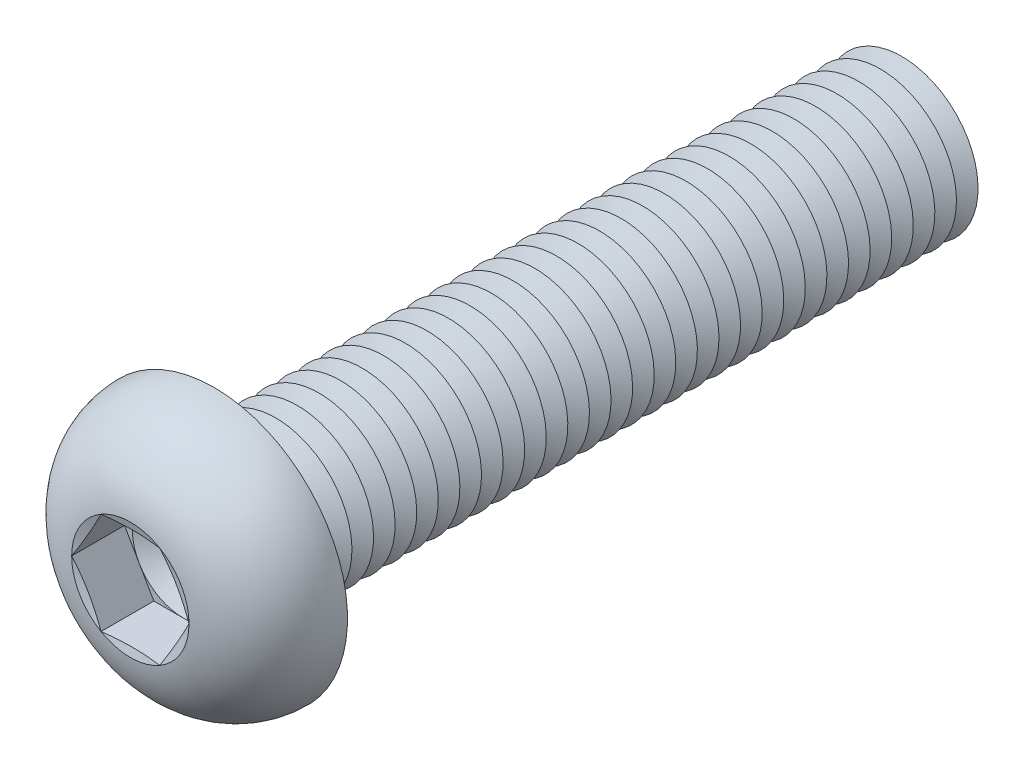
ISO-10303-21;
HEADER;
FILE_DESCRIPTION(('STEP AP214'),'2;1');
FILE_NAME('part.step','',(''),(''),'','','');
FILE_SCHEMA(('AUTOMOTIVE_DESIGN { 1 0 10303 214 1 1 1 1 }'));
ENDSEC;
DATA;
#1=APPLICATION_CONTEXT('core data for automotive mechanical design processes');
#2=APPLICATION_PROTOCOL_DEFINITION('international standard','automotive_design',2000,#1);
#3=PRODUCT_CONTEXT('',#1,'mechanical');
#4=PRODUCT('Part','Part','',(#3));
#5=PRODUCT_RELATED_PRODUCT_CATEGORY('part','',(#4));
#6=PRODUCT_DEFINITION_FORMATION('','',#4);
#7=PRODUCT_DEFINITION_CONTEXT('part definition',#1,'design');
#8=PRODUCT_DEFINITION('design','',#6,#7);
#9=PRODUCT_DEFINITION_SHAPE('','',#8);
#10=(LENGTH_UNIT() NAMED_UNIT(*) SI_UNIT(.MILLI.,.METRE.));
#11=(NAMED_UNIT(*) PLANE_ANGLE_UNIT() SI_UNIT($,.RADIAN.));
#12=(NAMED_UNIT(*) SI_UNIT($,.STERADIAN.) SOLID_ANGLE_UNIT());
#13=UNCERTAINTY_MEASURE_WITH_UNIT(LENGTH_MEASURE(1.E-05),#10,'distance_accuracy_value','');
#14=(GEOMETRIC_REPRESENTATION_CONTEXT(3) GLOBAL_UNCERTAINTY_ASSIGNED_CONTEXT((#13)) GLOBAL_UNIT_ASSIGNED_CONTEXT((#10,
#11,#12)) REPRESENTATION_CONTEXT('',''));
#15=CARTESIAN_POINT('',(0.,0.,0.));
#16=DIRECTION('',(0.,0.,1.));
#17=DIRECTION('',(1.,0.,0.));
#18=AXIS2_PLACEMENT_3D('',#15,#16,#17);
#19=CARTESIAN_POINT('',(0.,0.,2.43999999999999));
#20=DIRECTION('',(0.,0.,1.));
#21=DIRECTION('',(1.,0.,0.));
#22=AXIS2_PLACEMENT_3D('',#19,#20,#21);
#23=PLANE('',#22);
#24=CARTESIAN_POINT('',(0.,0.,2.43999999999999));
#25=DIRECTION('',(0.,0.,1.));
#26=DIRECTION('',(1.,0.,0.));
#27=AXIS2_PLACEMENT_3D('',#24,#25,#26);
#28=CIRCLE('',#27,3.99999813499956);
#29=CARTESIAN_POINT('',(3.4641,1.99999906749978,2.43999999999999));
#30=VERTEX_POINT('',#29);
#31=CARTESIAN_POINT('',(0.,3.99999813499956,2.43999999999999));
#32=VERTEX_POINT('',#31);
#33=EDGE_CURVE('E118',#30,#32,#28,.T.);
#34=ORIENTED_EDGE('',*,*,#33,.F.);
#35=DIRECTION('',(-0.5,0.866025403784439,0.));
#36=VECTOR('',#35,1.);
#37=CARTESIAN_POINT('',(4.6188,0.,2.43999999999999));
#38=LINE('',#37,#36);
#39=CARTESIAN_POINT('',(2.3094,3.99999813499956,2.43999999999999));
#40=VERTEX_POINT('',#39);
#41=EDGE_CURVE('E125',#30,#40,#38,.T.);
#42=ORIENTED_EDGE('',*,*,#41,.T.);
#43=DIRECTION('',(-1.,0.,0.));
#44=VECTOR('',#43,1.);
#45=CARTESIAN_POINT('',(2.3094,3.99999813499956,2.43999999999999));
#46=LINE('',#45,#44);
#47=EDGE_CURVE('E136',#40,#32,#46,.T.);
#48=ORIENTED_EDGE('',*,*,#47,.T.);
#49=EDGE_LOOP('',(#34,#42,#48));
#50=FACE_BOUND('',#49,.T.);
#51=ADVANCED_FACE('F39',(#50),#23,.T.);
#52=CARTESIAN_POINT('',(0.,0.,2.43999999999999));
#53=DIRECTION('',(0.,0.,1.));
#54=DIRECTION('',(1.,0.,0.));
#55=AXIS2_PLACEMENT_3D('',#52,#53,#54);
#56=CIRCLE('',#55,3.99999813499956);
#57=CARTESIAN_POINT('',(-3.4641,1.99999906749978,2.43999999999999));
#58=VERTEX_POINT('',#57);
#59=EDGE_CURVE('E11',#32,#58,#56,.T.);
#60=ORIENTED_EDGE('',*,*,#59,.F.);
#61=CARTESIAN_POINT('',(-2.3094,3.99999813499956,2.43999999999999));
#62=VERTEX_POINT('',#61);
#63=EDGE_CURVE('E131',#32,#62,#46,.T.);
#64=ORIENTED_EDGE('',*,*,#63,.T.);
#65=DIRECTION('',(-0.5,-0.866025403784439,0.));
#66=VECTOR('',#65,1.);
#67=CARTESIAN_POINT('',(-2.3094,3.99999813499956,2.43999999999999));
#68=LINE('',#67,#66);
#69=EDGE_CURVE('E134',#62,#58,#68,.T.);
#70=ORIENTED_EDGE('',*,*,#69,.T.);
#71=EDGE_LOOP('',(#60,#64,#70));
#72=FACE_BOUND('',#71,.T.);
#73=ADVANCED_FACE('F130',(#72),#23,.T.);
#74=CARTESIAN_POINT('',(-3.4641,-1.99999906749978,2.43999999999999));
#75=VERTEX_POINT('',#74);
#76=EDGE_CURVE('E49',#58,#75,#56,.T.);
#77=ORIENTED_EDGE('',*,*,#76,.F.);
#78=CARTESIAN_POINT('',(-4.6188,0.,2.43999999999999));
#79=VERTEX_POINT('',#78);
#80=EDGE_CURVE('E143',#58,#79,#68,.T.);
#81=ORIENTED_EDGE('',*,*,#80,.T.);
#82=DIRECTION('',(0.5,-0.866025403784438,0.));
#83=VECTOR('',#82,1.);
#84=CARTESIAN_POINT('',(-4.6188,0.,2.43999999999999));
#85=LINE('',#84,#83);
#86=EDGE_CURVE('E151',#79,#75,#85,.T.);
#87=ORIENTED_EDGE('',*,*,#86,.T.);
#88=EDGE_LOOP('',(#77,#81,#87));
#89=FACE_BOUND('',#88,.T.);
#90=ADVANCED_FACE('F529',(#89),#23,.T.);
#91=CARTESIAN_POINT('',(0.,-3.99999813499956,2.43999999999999));
#92=VERTEX_POINT('',#91);
#93=EDGE_CURVE('E513',#75,#92,#56,.T.);
#94=ORIENTED_EDGE('',*,*,#93,.F.);
#95=CARTESIAN_POINT('',(-2.3094,-3.99999813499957,2.43999999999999));
#96=VERTEX_POINT('',#95);
#97=EDGE_CURVE('E150',#75,#96,#85,.T.);
#98=ORIENTED_EDGE('',*,*,#97,.T.);
#99=DIRECTION('',(1.,0.,0.));
#100=VECTOR('',#99,1.);
#101=CARTESIAN_POINT('',(-2.3094,-3.99999813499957,2.43999999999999));
#102=LINE('',#101,#100);
#103=EDGE_CURVE('E156',#96,#92,#102,.T.);
#104=ORIENTED_EDGE('',*,*,#103,.T.);
#105=EDGE_LOOP('',(#94,#98,#104));
#106=FACE_BOUND('',#105,.T.);
#107=ADVANCED_FACE('F522',(#106),#23,.T.);
#108=CARTESIAN_POINT('',(3.4641,-1.99999906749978,2.43999999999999));
#109=VERTEX_POINT('',#108);
#110=EDGE_CURVE('E56',#92,#109,#56,.T.);
#111=ORIENTED_EDGE('',*,*,#110,.F.);
#112=CARTESIAN_POINT('',(2.3094,-3.99999813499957,2.43999999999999));
#113=VERTEX_POINT('',#112);
#114=EDGE_CURVE('E155',#92,#113,#102,.T.);
#115=ORIENTED_EDGE('',*,*,#114,.T.);
#116=DIRECTION('',(0.5,0.866025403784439,0.));
#117=VECTOR('',#116,1.);
#118=CARTESIAN_POINT('',(2.3094,-3.99999813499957,2.43999999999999));
#119=LINE('',#118,#117);
#120=EDGE_CURVE('E161',#113,#109,#119,.T.);
#121=ORIENTED_EDGE('',*,*,#120,.T.);
#122=EDGE_LOOP('',(#111,#115,#121));
#123=FACE_BOUND('',#122,.T.);
#124=ADVANCED_FACE('F599',(#123),#23,.T.);
#125=CARTESIAN_POINT('',(0.,0.,6.59999999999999));
#126=DIRECTION('',(0.,0.,1.));
#127=DIRECTION('',(0.,-1.,0.));
#128=AXIS2_PLACEMENT_3D('',#125,#126,#127);
#129=CONICAL_SURFACE('',#128,4.6188,1.30899693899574);
#130=CARTESIAN_POINT('',(4.61891547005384,-0.000200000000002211,6.6000309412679));
#131=CARTESIAN_POINT('',(4.52300232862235,0.165926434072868,6.57431944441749));
#132=CARTESIAN_POINT('',(4.42691527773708,0.332354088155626,6.55097758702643));
#133=CARTESIAN_POINT('',(4.23440181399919,0.665797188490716,6.50996805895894));
#134=CARTESIAN_POINT('',(4.13797527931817,0.83281284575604,6.49230269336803));
#135=CARTESIAN_POINT('',(3.94536752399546,1.16641926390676,6.46367750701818));
#136=CARTESIAN_POINT('',(3.84918760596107,1.33300776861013,6.45268354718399));
#137=CARTESIAN_POINT('',(3.6567051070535,1.66639723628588,6.4379417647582));
#138=CARTESIAN_POINT('',(3.56040255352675,1.83319815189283,6.43419253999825));
#139=CARTESIAN_POINT('',(3.36779744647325,2.16679998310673,6.43419253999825));
#140=CARTESIAN_POINT('',(3.2714948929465,2.33360089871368,6.4379417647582));
#141=CARTESIAN_POINT('',(3.07901239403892,2.66699036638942,6.45268354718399));
#142=CARTESIAN_POINT('',(2.98283247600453,2.8335788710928,6.46367750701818));
#143=CARTESIAN_POINT('',(2.79022472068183,3.16718528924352,6.49230269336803));
#144=CARTESIAN_POINT('',(2.69379818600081,3.33420094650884,6.50996805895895));
#145=CARTESIAN_POINT('',(2.50128472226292,3.66764404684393,6.55097758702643));
#146=CARTESIAN_POINT('',(2.40519767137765,3.83407170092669,6.57431944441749));
#147=CARTESIAN_POINT('',(2.30928452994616,4.00019813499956,6.6000309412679));
#148=B_SPLINE_CURVE_WITH_KNOTS('',3,(#130,#131,#132,#133,#134,#135,#136,#137,#138,#139,#140,
#141,#142,#143,#144,#145,#146,#147),.UNSPECIFIED.,.F.,.F.,(4,2,2,2,2,2,2,2,4),(0.,
0.580655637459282,1.16154676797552,1.73943971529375,2.31722080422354,2.89500189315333,
3.47289484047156,4.05378597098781,4.63444160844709),.UNSPECIFIED.);
#149=CARTESIAN_POINT('',(4.6188,0.,6.59999999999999));
#150=VERTEX_POINT('',#149);
#151=CARTESIAN_POINT('',(2.30940000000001,3.99999813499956,6.6));
#152=VERTEX_POINT('',#151);
#153=EDGE_CURVE('E220',#150,#152,#148,.T.);
#154=ORIENTED_EDGE('',*,*,#153,.F.);
#155=CARTESIAN_POINT('',(0.,0.,6.59999999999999));
#156=DIRECTION('',(0.,0.,-1.));
#157=DIRECTION('',(0.,1.,0.));
#158=AXIS2_PLACEMENT_3D('',#155,#156,#157);
#159=CIRCLE('',#158,4.6188);
#160=EDGE_CURVE('E492',#152,#150,#159,.T.);
#161=ORIENTED_EDGE('',*,*,#160,.F.);
#162=EDGE_LOOP('',(#154,#161));
#163=FACE_BOUND('',#162,.T.);
#164=ADVANCED_FACE('F603',(#163),#129,.F.);
#165=CARTESIAN_POINT('',(2.30928452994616,-4.00019813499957,6.6000309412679));
#166=CARTESIAN_POINT('',(2.40519767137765,-3.8340717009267,6.57431944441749));
#167=CARTESIAN_POINT('',(2.50128472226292,-3.66764404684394,6.55097758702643));
#168=CARTESIAN_POINT('',(2.69379818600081,-3.33420094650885,6.50996805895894));
#169=CARTESIAN_POINT('',(2.79022472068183,-3.16718528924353,6.49230269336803));
#170=CARTESIAN_POINT('',(2.98283247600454,-2.8335788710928,6.46367750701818));
#171=CARTESIAN_POINT('',(3.07901239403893,-2.66699036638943,6.45268354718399));
#172=CARTESIAN_POINT('',(3.2714948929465,-2.33360089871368,6.4379417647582));
#173=CARTESIAN_POINT('',(3.36779744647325,-2.16679998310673,6.43419253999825));
#174=CARTESIAN_POINT('',(3.56040255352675,-1.83319815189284,6.43419253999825));
#175=CARTESIAN_POINT('',(3.6567051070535,-1.66639723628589,6.4379417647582));
#176=CARTESIAN_POINT('',(3.84918760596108,-1.33300776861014,6.45268354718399));
#177=CARTESIAN_POINT('',(3.94536752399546,-1.16641926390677,6.46367750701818));
#178=CARTESIAN_POINT('',(4.13797527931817,-0.832812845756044,6.49230269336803));
#179=CARTESIAN_POINT('',(4.23440181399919,-0.66579718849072,6.50996805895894));
#180=CARTESIAN_POINT('',(4.42691527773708,-0.332354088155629,6.55097758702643));
#181=CARTESIAN_POINT('',(4.52300232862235,-0.165926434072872,6.57431944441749));
#182=CARTESIAN_POINT('',(4.61891547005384,0.000199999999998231,6.6000309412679));
#183=B_SPLINE_CURVE_WITH_KNOTS('',3,(#165,#166,#167,#168,#169,#170,#171,#172,#173,#174,#175,
#176,#177,#178,#179,#180,#181,#182),.UNSPECIFIED.,.F.,.F.,(4,2,2,2,2,2,2,2,4),(0.,
0.580655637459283,1.16154676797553,1.73943971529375,2.31722080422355,2.89500189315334,
3.47289484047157,4.05378597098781,4.63444160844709),.UNSPECIFIED.);
#184=CARTESIAN_POINT('',(2.3094,-3.99999813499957,6.59999999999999));
#185=VERTEX_POINT('',#184);
#186=EDGE_CURVE('E229',#185,#150,#183,.T.);
#187=ORIENTED_EDGE('',*,*,#186,.F.);
#188=EDGE_CURVE('E497',#150,#185,#159,.T.);
#189=ORIENTED_EDGE('',*,*,#188,.F.);
#190=EDGE_LOOP('',(#187,#189));
#191=FACE_BOUND('',#190,.T.);
#192=ADVANCED_FACE('F564',(#191),#129,.F.);
#193=CARTESIAN_POINT('',(-6.96966750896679,-3.99999813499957,7.51561854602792));
#194=CARTESIAN_POINT('',(-6.80094634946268,-3.99999813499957,7.47641178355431));
#195=CARTESIAN_POINT('',(-6.63214895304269,-3.99999813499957,7.43753277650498));
#196=CARTESIAN_POINT('',(-6.29436999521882,-3.99999813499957,7.36057075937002));
#197=CARTESIAN_POINT('',(-6.12538843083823,-3.99999813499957,7.3224877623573));
#198=CARTESIAN_POINT('',(-5.61806276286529,-3.99999813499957,7.20963087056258));
#199=CARTESIAN_POINT('',(-5.27940301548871,-3.99999813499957,7.13626437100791));
#200=CARTESIAN_POINT('',(-4.5977576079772,-3.99999813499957,6.99431141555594));
#201=CARTESIAN_POINT('',(-4.25476115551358,-3.99999813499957,6.92577621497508));
#202=CARTESIAN_POINT('',(-3.56716783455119,-3.99999813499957,6.79696563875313));
#203=CARTESIAN_POINT('',(-3.22257082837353,-3.99999813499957,6.73669098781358));
#204=CARTESIAN_POINT('',(-2.54069952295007,-3.99999813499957,6.63002020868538));
#205=CARTESIAN_POINT('',(-2.20347918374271,-3.99999813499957,6.58329286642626));
#206=CARTESIAN_POINT('',(-1.6962445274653,-3.99999813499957,6.52585827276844));
#207=CARTESIAN_POINT('',(-1.52694760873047,-3.99999813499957,6.50882377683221));
#208=CARTESIAN_POINT('',(-1.187938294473,-3.99999813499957,6.47963274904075));
#209=CARTESIAN_POINT('',(-1.01822592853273,-3.99999813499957,6.4674758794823));
#210=CARTESIAN_POINT('',(-0.679233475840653,-3.99999813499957,6.44863176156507));
#211=CARTESIAN_POINT('',(-0.509954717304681,-3.99999813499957,6.44192096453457));
#212=CARTESIAN_POINT('',(-0.171265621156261,-3.99999813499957,6.43422163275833));
#213=CARTESIAN_POINT('',(-0.0018552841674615,-3.99999813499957,6.43323307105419));
#214=CARTESIAN_POINT('',(0.336912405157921,-3.99999813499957,6.43703123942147));
#215=CARTESIAN_POINT('',(0.506269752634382,-3.99999813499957,6.44181839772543));
#216=CARTESIAN_POINT('',(0.844732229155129,-3.99999813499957,6.45691823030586));
#217=CARTESIAN_POINT('',(1.0138373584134,-3.99999813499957,6.46723089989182));
#218=CARTESIAN_POINT('',(1.42449950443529,-3.99999813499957,6.49843349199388));
#219=CARTESIAN_POINT('',(1.66585565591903,-3.99999813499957,6.52196685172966));
#220=CARTESIAN_POINT('',(2.14755410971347,-3.99999813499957,6.57749710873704));
#221=CARTESIAN_POINT('',(2.3878964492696,-3.99999813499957,6.60949369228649));
#222=CARTESIAN_POINT('',(2.86835569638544,-3.99999813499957,6.68017769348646));
#223=CARTESIAN_POINT('',(3.10846949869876,-3.99999813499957,6.71888590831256));
#224=CARTESIAN_POINT('',(3.5878341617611,-3.99999813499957,6.80132981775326));
#225=CARTESIAN_POINT('',(3.82708497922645,-3.99999813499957,6.84506576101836));
#226=CARTESIAN_POINT('',(4.30977392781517,-3.99999813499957,6.93726543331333));
#227=CARTESIAN_POINT('',(4.55319689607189,-3.99999813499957,6.98580793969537));
#228=CARTESIAN_POINT('',(5.03943022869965,-3.99999813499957,7.08586668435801));
#229=CARTESIAN_POINT('',(5.28224058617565,-3.99999813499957,7.13738295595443));
#230=CARTESIAN_POINT('',(5.76604885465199,-3.99999813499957,7.24238429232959));
#231=CARTESIAN_POINT('',(6.00704943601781,-3.99999813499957,7.29585711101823));
#232=CARTESIAN_POINT('',(6.48863948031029,-3.99999813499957,7.4045482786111));
#233=CARTESIAN_POINT('',(6.72922897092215,-3.99999813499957,7.45976650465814));
#234=CARTESIAN_POINT('',(6.9696675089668,-3.99999813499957,7.51561854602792));
#235=B_SPLINE_CURVE_WITH_KNOTS('',3,(#193,#194,#195,#196,#197,#198,#199,#200,#201,#202,#203,
#204,#205,#206,#207,#208,#209,#210,#211,#212,#213,#214,#215,#216,#217,#218,#219,#220,#221,#222,
#223,#224,#225,#226,#227,#228,#229,#230,#231,#232,#233,#234),.UNSPECIFIED.,.F.,.F.,(4,2,2,2,2,2,
2,2,2,2,2,2,2,2,2,2,2,2,2,2,4),(0.,0.519649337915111,1.03930720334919,2.07882421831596,
3.12808572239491,4.17743921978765,5.19841727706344,5.7088142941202,6.21917596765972,
6.7273189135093,7.23545946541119,7.74363769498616,8.25181549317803,8.9791183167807,
9.70639418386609,10.4359652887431,11.1655724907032,11.910195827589,12.6548275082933,
13.395405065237,14.1359306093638),.UNSPECIFIED.);
#236=CARTESIAN_POINT('',(-2.3094,-3.99999813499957,6.59999999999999));
#237=VERTEX_POINT('',#236);
#238=EDGE_CURVE('E543',#237,#185,#235,.T.);
#239=ORIENTED_EDGE('',*,*,#238,.F.);
#240=EDGE_CURVE('E556',#185,#237,#159,.T.);
#241=ORIENTED_EDGE('',*,*,#240,.F.);
#242=EDGE_LOOP('',(#239,#241));
#243=FACE_BOUND('',#242,.T.);
#244=ADVANCED_FACE('F570',(#243),#129,.F.);
#245=CARTESIAN_POINT('',(-4.61891547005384,0.000199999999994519,6.6000309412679));
#246=CARTESIAN_POINT('',(-4.52300232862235,-0.165926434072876,6.57431944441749));
#247=CARTESIAN_POINT('',(-4.42691527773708,-0.332354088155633,6.55097758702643));
#248=CARTESIAN_POINT('',(-4.23440181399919,-0.665797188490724,6.50996805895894));
#249=CARTESIAN_POINT('',(-4.13797527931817,-0.832812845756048,6.49230269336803));
#250=CARTESIAN_POINT('',(-3.94536752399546,-1.16641926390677,6.46367750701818));
#251=CARTESIAN_POINT('',(-3.84918760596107,-1.33300776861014,6.45268354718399));
#252=CARTESIAN_POINT('',(-3.6567051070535,-1.66639723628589,6.4379417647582));
#253=CARTESIAN_POINT('',(-3.56040255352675,-1.83319815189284,6.43419253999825));
#254=CARTESIAN_POINT('',(-3.36779744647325,-2.16679998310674,6.43419253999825));
#255=CARTESIAN_POINT('',(-3.2714948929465,-2.33360089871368,6.4379417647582));
#256=CARTESIAN_POINT('',(-3.07901239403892,-2.66699036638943,6.45268354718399));
#257=CARTESIAN_POINT('',(-2.98283247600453,-2.83357887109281,6.46367750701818));
#258=CARTESIAN_POINT('',(-2.79022472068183,-3.16718528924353,6.49230269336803));
#259=CARTESIAN_POINT('',(-2.69379818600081,-3.33420094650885,6.50996805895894));
#260=CARTESIAN_POINT('',(-2.50128472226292,-3.66764404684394,6.55097758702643));
#261=CARTESIAN_POINT('',(-2.40519767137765,-3.8340717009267,6.57431944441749));
#262=CARTESIAN_POINT('',(-2.30928452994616,-4.00019813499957,6.60003094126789));
#263=B_SPLINE_CURVE_WITH_KNOTS('',3,(#245,#246,#247,#248,#249,#250,#251,#252,#253,#254,#255,
#256,#257,#258,#259,#260,#261,#262),.UNSPECIFIED.,.F.,.F.,(4,2,2,2,2,2,2,2,4),(0.,
0.580655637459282,1.16154676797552,1.73943971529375,2.31722080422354,2.89500189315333,
3.47289484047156,4.05378597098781,4.63444160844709),.UNSPECIFIED.);
#264=CARTESIAN_POINT('',(-4.6188,0.,6.59999999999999));
#265=VERTEX_POINT('',#264);
#266=EDGE_CURVE('E534',#265,#237,#263,.T.);
#267=ORIENTED_EDGE('',*,*,#266,.F.);
#268=EDGE_CURVE('E540',#237,#265,#159,.T.);
#269=ORIENTED_EDGE('',*,*,#268,.F.);
#270=EDGE_LOOP('',(#267,#269));
#271=FACE_BOUND('',#270,.T.);
#272=ADVANCED_FACE('F538',(#271),#129,.F.);
#273=CARTESIAN_POINT('',(-2.30928452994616,4.00019813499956,6.6000309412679));
#274=CARTESIAN_POINT('',(-2.40519767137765,3.83407170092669,6.57431944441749));
#275=CARTESIAN_POINT('',(-2.50128472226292,3.66764404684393,6.55097758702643));
#276=CARTESIAN_POINT('',(-2.69379818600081,3.33420094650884,6.50996805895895));
#277=CARTESIAN_POINT('',(-2.79022472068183,3.16718528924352,6.49230269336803));
#278=CARTESIAN_POINT('',(-2.98283247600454,2.8335788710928,6.46367750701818));
#279=CARTESIAN_POINT('',(-3.07901239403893,2.66699036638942,6.45268354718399));
#280=CARTESIAN_POINT('',(-3.2714948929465,2.33360089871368,6.4379417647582));
#281=CARTESIAN_POINT('',(-3.36779744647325,2.16679998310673,6.43419253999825));
#282=CARTESIAN_POINT('',(-3.56040255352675,1.83319815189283,6.43419253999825));
#283=CARTESIAN_POINT('',(-3.6567051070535,1.66639723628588,6.4379417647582));
#284=CARTESIAN_POINT('',(-3.84918760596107,1.33300776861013,6.45268354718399));
#285=CARTESIAN_POINT('',(-3.94536752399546,1.16641926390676,6.46367750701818));
#286=CARTESIAN_POINT('',(-4.13797527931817,0.832812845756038,6.49230269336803));
#287=CARTESIAN_POINT('',(-4.23440181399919,0.665797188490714,6.50996805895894));
#288=CARTESIAN_POINT('',(-4.42691527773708,0.332354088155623,6.55097758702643));
#289=CARTESIAN_POINT('',(-4.52300232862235,0.165926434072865,6.57431944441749));
#290=CARTESIAN_POINT('',(-4.61891547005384,-0.000200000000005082,6.6000309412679));
#291=B_SPLINE_CURVE_WITH_KNOTS('',3,(#273,#274,#275,#276,#277,#278,#279,#280,#281,#282,#283,
#284,#285,#286,#287,#288,#289,#290),.UNSPECIFIED.,.F.,.F.,(4,2,2,2,2,2,2,2,4),(0.,
0.580655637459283,1.16154676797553,1.73943971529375,2.31722080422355,2.89500189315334,
3.47289484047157,4.05378597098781,4.63444160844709),.UNSPECIFIED.);
#292=CARTESIAN_POINT('',(-2.3094,3.99999813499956,6.59999999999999));
#293=VERTEX_POINT('',#292);
#294=EDGE_CURVE('E193',#293,#265,#291,.T.);
#295=ORIENTED_EDGE('',*,*,#294,.F.);
#296=EDGE_CURVE('E546',#265,#293,#159,.T.);
#297=ORIENTED_EDGE('',*,*,#296,.F.);
#298=EDGE_LOOP('',(#295,#297));
#299=FACE_BOUND('',#298,.T.);
#300=ADVANCED_FACE('F547',(#299),#129,.F.);
#301=CARTESIAN_POINT('',(0.,0.,-49.05));
#302=DIRECTION('',(0.,0.,1.));
#303=DIRECTION('',(0.,-1.,0.));
#304=AXIS2_PLACEMENT_3D('',#301,#302,#303);
#305=CONICAL_SURFACE('',#304,5.99999999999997,1.0471975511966);
#306=CARTESIAN_POINT('',(0.,0.,-49.9));
#307=DIRECTION('',(0.,0.,1.));
#308=DIRECTION('',(0.,-1.,0.));
#309=AXIS2_PLACEMENT_3D('',#306,#307,#308);
#310=CIRCLE('',#309,4.52775681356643);
#311=CARTESIAN_POINT('',(0.,-4.5277568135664,-49.9));
#312=VERTEX_POINT('',#311);
#313=EDGE_CURVE('E463',#312,#312,#310,.T.);
#314=ORIENTED_EDGE('',*,*,#313,.T.);
#315=EDGE_LOOP('',(#314));
#316=FACE_BOUND('',#315,.T.);
#317=CARTESIAN_POINT('',(0.,0.,-49.05));
#318=DIRECTION('',(0.,0.,1.));
#319=DIRECTION('',(0.,-1.,0.));
#320=AXIS2_PLACEMENT_3D('',#317,#318,#319);
#321=CIRCLE('',#320,5.99999999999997);
#322=CARTESIAN_POINT('',(0.,-5.99999999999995,-49.05));
#323=VERTEX_POINT('',#322);
#324=EDGE_CURVE('E459',#323,#323,#321,.T.);
#325=ORIENTED_EDGE('',*,*,#324,.F.);
#326=EDGE_LOOP('',(#325));
#327=FACE_BOUND('',#326,.T.);
#328=ADVANCED_FACE('F629',(#316,#327),#305,.T.);
#329=CARTESIAN_POINT('',(0.,0.,-49.9));
#330=DIRECTION('',(0.,0.,-1.));
#331=DIRECTION('',(0.,1.,0.));
#332=AXIS2_PLACEMENT_3D('',#329,#330,#331);
#333=CONICAL_SURFACE('',#332,4.52775681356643,1.0471975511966);
#334=CARTESIAN_POINT('',(0.,0.,-50.75));
#335=DIRECTION('',(0.,0.,1.));
#336=DIRECTION('',(0.,-1.,0.));
#337=AXIS2_PLACEMENT_3D('',#334,#335,#336);
#338=CIRCLE('',#337,5.99999999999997);
#339=CARTESIAN_POINT('',(0.,-5.99999999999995,-50.75));
#340=VERTEX_POINT('',#339);
#341=EDGE_CURVE('E467',#340,#340,#338,.T.);
#342=ORIENTED_EDGE('',*,*,#341,.T.);
#343=EDGE_LOOP('',(#342));
#344=FACE_BOUND('',#343,.T.);
#345=ORIENTED_EDGE('',*,*,#313,.F.);
#346=EDGE_LOOP('',(#345));
#347=FACE_BOUND('',#346,.T.);
#348=ADVANCED_FACE('F634',(#344,#347),#333,.T.);
#349=CARTESIAN_POINT('',(0.,5.99999999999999,-55.));
#350=DIRECTION('',(0.,0.,-1.));
#351=DIRECTION('',(0.,1.,0.));
#352=AXIS2_PLACEMENT_3D('',#349,#350,#351);
#353=PLANE('',#352);
#354=CARTESIAN_POINT('',(0.,0.,-55.));
#355=DIRECTION('',(0.,0.,1.));
#356=DIRECTION('',(0.,-1.,0.));
#357=AXIS2_PLACEMENT_3D('',#354,#355,#356);
#358=CIRCLE('',#357,4.52775681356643);
#359=CARTESIAN_POINT('',(0.,-4.5277568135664,-55.));
#360=VERTEX_POINT('',#359);
#361=EDGE_CURVE('E487',#360,#360,#358,.T.);
#362=ORIENTED_EDGE('',*,*,#361,.F.);
#363=EDGE_LOOP('',(#362));
#364=FACE_BOUND('',#363,.T.);
#365=ADVANCED_FACE('F809',(#364),#353,.T.);
#366=CARTESIAN_POINT('',(0.,0.,-54.15));
#367=DIRECTION('',(0.,0.,1.));
#368=DIRECTION('',(0.,-1.,0.));
#369=AXIS2_PLACEMENT_3D('',#366,#367,#368);
#370=CONICAL_SURFACE('',#369,5.99999999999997,1.0471975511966);
#371=ORIENTED_EDGE('',*,*,#361,.T.);
#372=EDGE_LOOP('',(#371));
#373=FACE_BOUND('',#372,.T.);
#374=CARTESIAN_POINT('',(0.,0.,-54.15));
#375=DIRECTION('',(0.,0.,1.));
#376=DIRECTION('',(0.,-1.,0.));
#377=AXIS2_PLACEMENT_3D('',#374,#375,#376);
#378=CIRCLE('',#377,5.99999999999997);
#379=CARTESIAN_POINT('',(0.,-5.99999999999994,-54.15));
#380=VERTEX_POINT('',#379);
#381=EDGE_CURVE('E483',#380,#380,#378,.T.);
#382=ORIENTED_EDGE('',*,*,#381,.F.);
#383=EDGE_LOOP('',(#382));
#384=FACE_BOUND('',#383,.T.);
#385=ADVANCED_FACE('F802',(#373,#384),#370,.T.);
#386=CARTESIAN_POINT('',(0.,0.,-53.3));
#387=DIRECTION('',(0.,0.,-1.));
#388=DIRECTION('',(0.,1.,0.));
#389=AXIS2_PLACEMENT_3D('',#386,#387,#388);
#390=CONICAL_SURFACE('',#389,4.52775681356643,1.0471975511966);
#391=ORIENTED_EDGE('',*,*,#381,.T.);
#392=EDGE_LOOP('',(#391));
#393=FACE_BOUND('',#392,.T.);
#394=CARTESIAN_POINT('',(0.,0.,-53.3));
#395=DIRECTION('',(0.,0.,1.));
#396=DIRECTION('',(0.,-1.,0.));
#397=AXIS2_PLACEMENT_3D('',#394,#395,#396);
#398=CIRCLE('',#397,4.52775681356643);
#399=CARTESIAN_POINT('',(0.,-4.5277568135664,-53.3));
#400=VERTEX_POINT('',#399);
#401=EDGE_CURVE('E479',#400,#400,#398,.T.);
#402=ORIENTED_EDGE('',*,*,#401,.F.);
#403=EDGE_LOOP('',(#402));
#404=FACE_BOUND('',#403,.T.);
#405=ADVANCED_FACE('F808',(#393,#404),#390,.T.);
#406=CARTESIAN_POINT('',(0.,0.,-52.45));
#407=DIRECTION('',(0.,0.,1.));
#408=DIRECTION('',(0.,-1.,0.));
#409=AXIS2_PLACEMENT_3D('',#406,#407,#408);
#410=CONICAL_SURFACE('',#409,5.99999999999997,1.0471975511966);
#411=ORIENTED_EDGE('',*,*,#401,.T.);
#412=EDGE_LOOP('',(#411));
#413=FACE_BOUND('',#412,.T.);
#414=CARTESIAN_POINT('',(0.,0.,-52.45));
#415=DIRECTION('',(0.,0.,1.));
#416=DIRECTION('',(0.,-1.,0.));
#417=AXIS2_PLACEMENT_3D('',#414,#415,#416);
#418=CIRCLE('',#417,5.99999999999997);
#419=CARTESIAN_POINT('',(0.,-5.99999999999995,-52.45));
#420=VERTEX_POINT('',#419);
#421=EDGE_CURVE('E475',#420,#420,#418,.T.);
#422=ORIENTED_EDGE('',*,*,#421,.F.);
#423=EDGE_LOOP('',(#422));
#424=FACE_BOUND('',#423,.T.);
#425=ADVANCED_FACE('F840',(#413,#424),#410,.T.);
#426=CARTESIAN_POINT('',(0.,0.,-51.6));
#427=DIRECTION('',(0.,0.,-1.));
#428=DIRECTION('',(0.,1.,0.));
#429=AXIS2_PLACEMENT_3D('',#426,#427,#428);
#430=CONICAL_SURFACE('',#429,4.52775681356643,1.0471975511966);
#431=ORIENTED_EDGE('',*,*,#421,.T.);
#432=EDGE_LOOP('',(#431));
#433=FACE_BOUND('',#432,.T.);
#434=CARTESIAN_POINT('',(0.,0.,-51.6));
#435=DIRECTION('',(0.,0.,1.));
#436=DIRECTION('',(0.,-1.,0.));
#437=AXIS2_PLACEMENT_3D('',#434,#435,#436);
#438=CIRCLE('',#437,4.52775681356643);
#439=CARTESIAN_POINT('',(0.,-4.5277568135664,-51.6));
#440=VERTEX_POINT('',#439);
#441=EDGE_CURVE('E471',#440,#440,#438,.T.);
#442=ORIENTED_EDGE('',*,*,#441,.F.);
#443=EDGE_LOOP('',(#442));
#444=FACE_BOUND('',#443,.T.);
#445=ADVANCED_FACE('F850',(#433,#444),#430,.T.);
#446=CARTESIAN_POINT('',(0.,0.,-50.75));
#447=DIRECTION('',(0.,0.,1.));
#448=DIRECTION('',(0.,-1.,0.));
#449=AXIS2_PLACEMENT_3D('',#446,#447,#448);
#450=CONICAL_SURFACE('',#449,5.99999999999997,1.0471975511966);
#451=ORIENTED_EDGE('',*,*,#441,.T.);
#452=EDGE_LOOP('',(#451));
#453=FACE_BOUND('',#452,.T.);
#454=ORIENTED_EDGE('',*,*,#341,.F.);
#455=EDGE_LOOP('',(#454));
#456=FACE_BOUND('',#455,.T.);
#457=ADVANCED_FACE('F860',(#453,#456),#450,.T.);
#458=CARTESIAN_POINT('',(0.,0.,-47.35));
#459=DIRECTION('',(0.,0.,1.));
#460=DIRECTION('',(0.,-1.,0.));
#461=AXIS2_PLACEMENT_3D('',#458,#459,#460);
#462=CONICAL_SURFACE('',#461,5.99999999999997,1.0471975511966);
#463=CARTESIAN_POINT('',(0.,0.,-48.2));
#464=DIRECTION('',(0.,0.,1.));
#465=DIRECTION('',(0.,-1.,0.));
#466=AXIS2_PLACEMENT_3D('',#463,#464,#465);
#467=CIRCLE('',#466,4.52775681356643);
#468=CARTESIAN_POINT('',(0.,-4.5277568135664,-48.2));
#469=VERTEX_POINT('',#468);
#470=EDGE_CURVE('E455',#469,#469,#467,.T.);
#471=ORIENTED_EDGE('',*,*,#470,.T.);
#472=EDGE_LOOP('',(#471));
#473=FACE_BOUND('',#472,.T.);
#474=CARTESIAN_POINT('',(0.,0.,-47.35));
#475=DIRECTION('',(0.,0.,1.));
#476=DIRECTION('',(0.,-1.,0.));
#477=AXIS2_PLACEMENT_3D('',#474,#475,#476);
#478=CIRCLE('',#477,5.99999999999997);
#479=CARTESIAN_POINT('',(0.,-5.99999999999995,-47.35));
#480=VERTEX_POINT('',#479);
#481=EDGE_CURVE('E451',#480,#480,#478,.T.);
#482=ORIENTED_EDGE('',*,*,#481,.F.);
#483=EDGE_LOOP('',(#482));
#484=FACE_BOUND('',#483,.T.);
#485=ADVANCED_FACE('F870',(#473,#484),#462,.T.);
#486=CARTESIAN_POINT('',(0.,0.,-48.2));
#487=DIRECTION('',(0.,0.,-1.));
#488=DIRECTION('',(0.,1.,0.));
#489=AXIS2_PLACEMENT_3D('',#486,#487,#488);
#490=CONICAL_SURFACE('',#489,4.52775681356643,1.0471975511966);
#491=ORIENTED_EDGE('',*,*,#324,.T.);
#492=EDGE_LOOP('',(#491));
#493=FACE_BOUND('',#492,.T.);
#494=ORIENTED_EDGE('',*,*,#470,.F.);
#495=EDGE_LOOP('',(#494));
#496=FACE_BOUND('',#495,.T.);
#497=ADVANCED_FACE('F880',(#493,#496),#490,.T.);
#498=CARTESIAN_POINT('',(0.,0.,-45.65));
#499=DIRECTION('',(0.,0.,1.));
#500=DIRECTION('',(0.,-1.,0.));
#501=AXIS2_PLACEMENT_3D('',#498,#499,#500);
#502=CONICAL_SURFACE('',#501,5.99999999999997,1.0471975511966);
#503=CARTESIAN_POINT('',(0.,0.,-46.5));
#504=DIRECTION('',(0.,0.,1.));
#505=DIRECTION('',(0.,-1.,0.));
#506=AXIS2_PLACEMENT_3D('',#503,#504,#505);
#507=CIRCLE('',#506,4.52775681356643);
#508=CARTESIAN_POINT('',(0.,-4.5277568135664,-46.5));
#509=VERTEX_POINT('',#508);
#510=EDGE_CURVE('E447',#509,#509,#507,.T.);
#511=ORIENTED_EDGE('',*,*,#510,.T.);
#512=EDGE_LOOP('',(#511));
#513=FACE_BOUND('',#512,.T.);
#514=CARTESIAN_POINT('',(0.,0.,-45.65));
#515=DIRECTION('',(0.,0.,1.));
#516=DIRECTION('',(0.,-1.,0.));
#517=AXIS2_PLACEMENT_3D('',#514,#515,#516);
#518=CIRCLE('',#517,5.99999999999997);
#519=CARTESIAN_POINT('',(0.,-5.99999999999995,-45.65));
#520=VERTEX_POINT('',#519);
#521=EDGE_CURVE('E443',#520,#520,#518,.T.);
#522=ORIENTED_EDGE('',*,*,#521,.F.);
#523=EDGE_LOOP('',(#522));
#524=FACE_BOUND('',#523,.T.);
#525=ADVANCED_FACE('F890',(#513,#524),#502,.T.);
#526=CARTESIAN_POINT('',(0.,0.,-46.5));
#527=DIRECTION('',(0.,0.,-1.));
#528=DIRECTION('',(0.,1.,0.));
#529=AXIS2_PLACEMENT_3D('',#526,#527,#528);
#530=CONICAL_SURFACE('',#529,4.52775681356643,1.0471975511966);
#531=ORIENTED_EDGE('',*,*,#481,.T.);
#532=EDGE_LOOP('',(#531));
#533=FACE_BOUND('',#532,.T.);
#534=ORIENTED_EDGE('',*,*,#510,.F.);
#535=EDGE_LOOP('',(#534));
#536=FACE_BOUND('',#535,.T.);
#537=ADVANCED_FACE('F900',(#533,#536),#530,.T.);
#538=CARTESIAN_POINT('',(0.,0.,-43.95));
#539=DIRECTION('',(0.,0.,1.));
#540=DIRECTION('',(0.,-1.,0.));
#541=AXIS2_PLACEMENT_3D('',#538,#539,#540);
#542=CONICAL_SURFACE('',#541,5.99999999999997,1.0471975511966);
#543=CARTESIAN_POINT('',(0.,0.,-44.8));
#544=DIRECTION('',(0.,0.,1.));
#545=DIRECTION('',(0.,-1.,0.));
#546=AXIS2_PLACEMENT_3D('',#543,#544,#545);
#547=CIRCLE('',#546,4.52775681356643);
#548=CARTESIAN_POINT('',(0.,-4.5277568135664,-44.8));
#549=VERTEX_POINT('',#548);
#550=EDGE_CURVE('E439',#549,#549,#547,.T.);
#551=ORIENTED_EDGE('',*,*,#550,.T.);
#552=EDGE_LOOP('',(#551));
#553=FACE_BOUND('',#552,.T.);
#554=CARTESIAN_POINT('',(0.,0.,-43.95));
#555=DIRECTION('',(0.,0.,1.));
#556=DIRECTION('',(0.,-1.,0.));
#557=AXIS2_PLACEMENT_3D('',#554,#555,#556);
#558=CIRCLE('',#557,5.99999999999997);
#559=CARTESIAN_POINT('',(0.,-5.99999999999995,-43.95));
#560=VERTEX_POINT('',#559);
#561=EDGE_CURVE('E435',#560,#560,#558,.T.);
#562=ORIENTED_EDGE('',*,*,#561,.F.);
#563=EDGE_LOOP('',(#562));
#564=FACE_BOUND('',#563,.T.);
#565=ADVANCED_FACE('F910',(#553,#564),#542,.T.);
#566=CARTESIAN_POINT('',(0.,0.,-44.8));
#567=DIRECTION('',(0.,0.,-1.));
#568=DIRECTION('',(0.,1.,0.));
#569=AXIS2_PLACEMENT_3D('',#566,#567,#568);
#570=CONICAL_SURFACE('',#569,4.52775681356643,1.0471975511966);
#571=ORIENTED_EDGE('',*,*,#521,.T.);
#572=EDGE_LOOP('',(#571));
#573=FACE_BOUND('',#572,.T.);
#574=ORIENTED_EDGE('',*,*,#550,.F.);
#575=EDGE_LOOP('',(#574));
#576=FACE_BOUND('',#575,.T.);
#577=ADVANCED_FACE('F920',(#573,#576),#570,.T.);
#578=CARTESIAN_POINT('',(0.,0.,-42.25));
#579=DIRECTION('',(0.,0.,1.));
#580=DIRECTION('',(0.,-1.,0.));
#581=AXIS2_PLACEMENT_3D('',#578,#579,#580);
#582=CONICAL_SURFACE('',#581,5.99999999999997,1.0471975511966);
#583=CARTESIAN_POINT('',(0.,0.,-43.1));
#584=DIRECTION('',(0.,0.,1.));
#585=DIRECTION('',(0.,-1.,0.));
#586=AXIS2_PLACEMENT_3D('',#583,#584,#585);
#587=CIRCLE('',#586,4.52775681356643);
#588=CARTESIAN_POINT('',(0.,-4.5277568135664,-43.1));
#589=VERTEX_POINT('',#588);
#590=EDGE_CURVE('E431',#589,#589,#587,.T.);
#591=ORIENTED_EDGE('',*,*,#590,.T.);
#592=EDGE_LOOP('',(#591));
#593=FACE_BOUND('',#592,.T.);
#594=CARTESIAN_POINT('',(0.,0.,-42.25));
#595=DIRECTION('',(0.,0.,1.));
#596=DIRECTION('',(0.,-1.,0.));
#597=AXIS2_PLACEMENT_3D('',#594,#595,#596);
#598=CIRCLE('',#597,5.99999999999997);
#599=CARTESIAN_POINT('',(0.,-5.99999999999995,-42.25));
#600=VERTEX_POINT('',#599);
#601=EDGE_CURVE('E427',#600,#600,#598,.T.);
#602=ORIENTED_EDGE('',*,*,#601,.F.);
#603=EDGE_LOOP('',(#602));
#604=FACE_BOUND('',#603,.T.);
#605=ADVANCED_FACE('F930',(#593,#604),#582,.T.);
#606=CARTESIAN_POINT('',(0.,0.,-43.1));
#607=DIRECTION('',(0.,0.,-1.));
#608=DIRECTION('',(0.,1.,0.));
#609=AXIS2_PLACEMENT_3D('',#606,#607,#608);
#610=CONICAL_SURFACE('',#609,4.52775681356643,1.0471975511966);
#611=ORIENTED_EDGE('',*,*,#561,.T.);
#612=EDGE_LOOP('',(#611));
#613=FACE_BOUND('',#612,.T.);
#614=ORIENTED_EDGE('',*,*,#590,.F.);
#615=EDGE_LOOP('',(#614));
#616=FACE_BOUND('',#615,.T.);
#617=ADVANCED_FACE('F940',(#613,#616),#610,.T.);
#618=CARTESIAN_POINT('',(0.,0.,-40.55));
#619=DIRECTION('',(0.,0.,1.));
#620=DIRECTION('',(0.,-1.,0.));
#621=AXIS2_PLACEMENT_3D('',#618,#619,#620);
#622=CONICAL_SURFACE('',#621,5.99999999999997,1.0471975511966);
#623=CARTESIAN_POINT('',(0.,0.,-41.4));
#624=DIRECTION('',(0.,0.,1.));
#625=DIRECTION('',(0.,-1.,0.));
#626=AXIS2_PLACEMENT_3D('',#623,#624,#625);
#627=CIRCLE('',#626,4.52775681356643);
#628=CARTESIAN_POINT('',(0.,-4.5277568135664,-41.4));
#629=VERTEX_POINT('',#628);
#630=EDGE_CURVE('E423',#629,#629,#627,.T.);
#631=ORIENTED_EDGE('',*,*,#630,.T.);
#632=EDGE_LOOP('',(#631));
#633=FACE_BOUND('',#632,.T.);
#634=CARTESIAN_POINT('',(0.,0.,-40.55));
#635=DIRECTION('',(0.,0.,1.));
#636=DIRECTION('',(0.,-1.,0.));
#637=AXIS2_PLACEMENT_3D('',#634,#635,#636);
#638=CIRCLE('',#637,5.99999999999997);
#639=CARTESIAN_POINT('',(0.,-5.99999999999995,-40.55));
#640=VERTEX_POINT('',#639);
#641=EDGE_CURVE('E419',#640,#640,#638,.T.);
#642=ORIENTED_EDGE('',*,*,#641,.F.);
#643=EDGE_LOOP('',(#642));
#644=FACE_BOUND('',#643,.T.);
#645=ADVANCED_FACE('F950',(#633,#644),#622,.T.);
#646=CARTESIAN_POINT('',(0.,0.,-41.4));
#647=DIRECTION('',(0.,0.,-1.));
#648=DIRECTION('',(0.,1.,0.));
#649=AXIS2_PLACEMENT_3D('',#646,#647,#648);
#650=CONICAL_SURFACE('',#649,4.52775681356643,1.0471975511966);
#651=ORIENTED_EDGE('',*,*,#601,.T.);
#652=EDGE_LOOP('',(#651));
#653=FACE_BOUND('',#652,.T.);
#654=ORIENTED_EDGE('',*,*,#630,.F.);
#655=EDGE_LOOP('',(#654));
#656=FACE_BOUND('',#655,.T.);
#657=ADVANCED_FACE('F960',(#653,#656),#650,.T.);
#658=CARTESIAN_POINT('',(0.,0.,-38.85));
#659=DIRECTION('',(0.,0.,1.));
#660=DIRECTION('',(0.,-1.,0.));
#661=AXIS2_PLACEMENT_3D('',#658,#659,#660);
#662=CONICAL_SURFACE('',#661,5.99999999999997,1.0471975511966);
#663=CARTESIAN_POINT('',(0.,0.,-39.7));
#664=DIRECTION('',(0.,0.,1.));
#665=DIRECTION('',(0.,-1.,0.));
#666=AXIS2_PLACEMENT_3D('',#663,#664,#665);
#667=CIRCLE('',#666,4.52775681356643);
#668=CARTESIAN_POINT('',(0.,-4.52775681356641,-39.7));
#669=VERTEX_POINT('',#668);
#670=EDGE_CURVE('E415',#669,#669,#667,.T.);
#671=ORIENTED_EDGE('',*,*,#670,.T.);
#672=EDGE_LOOP('',(#671));
#673=FACE_BOUND('',#672,.T.);
#674=CARTESIAN_POINT('',(0.,0.,-38.85));
#675=DIRECTION('',(0.,0.,1.));
#676=DIRECTION('',(0.,-1.,0.));
#677=AXIS2_PLACEMENT_3D('',#674,#675,#676);
#678=CIRCLE('',#677,5.99999999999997);
#679=CARTESIAN_POINT('',(0.,-5.99999999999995,-38.85));
#680=VERTEX_POINT('',#679);
#681=EDGE_CURVE('E411',#680,#680,#678,.T.);
#682=ORIENTED_EDGE('',*,*,#681,.F.);
#683=EDGE_LOOP('',(#682));
#684=FACE_BOUND('',#683,.T.);
#685=ADVANCED_FACE('F970',(#673,#684),#662,.T.);
#686=CARTESIAN_POINT('',(0.,0.,-39.7));
#687=DIRECTION('',(0.,0.,-1.));
#688=DIRECTION('',(0.,1.,0.));
#689=AXIS2_PLACEMENT_3D('',#686,#687,#688);
#690=CONICAL_SURFACE('',#689,4.52775681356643,1.0471975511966);
#691=ORIENTED_EDGE('',*,*,#641,.T.);
#692=EDGE_LOOP('',(#691));
#693=FACE_BOUND('',#692,.T.);
#694=ORIENTED_EDGE('',*,*,#670,.F.);
#695=EDGE_LOOP('',(#694));
#696=FACE_BOUND('',#695,.T.);
#697=ADVANCED_FACE('F980',(#693,#696),#690,.T.);
#698=CARTESIAN_POINT('',(0.,0.,-37.15));
#699=DIRECTION('',(0.,0.,1.));
#700=DIRECTION('',(0.,-1.,0.));
#701=AXIS2_PLACEMENT_3D('',#698,#699,#700);
#702=CONICAL_SURFACE('',#701,5.99999999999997,1.0471975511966);
#703=CARTESIAN_POINT('',(0.,0.,-38.));
#704=DIRECTION('',(0.,0.,1.));
#705=DIRECTION('',(0.,-1.,0.));
#706=AXIS2_PLACEMENT_3D('',#703,#704,#705);
#707=CIRCLE('',#706,4.52775681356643);
#708=CARTESIAN_POINT('',(0.,-4.52775681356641,-38.));
#709=VERTEX_POINT('',#708);
#710=EDGE_CURVE('E407',#709,#709,#707,.T.);
#711=ORIENTED_EDGE('',*,*,#710,.T.);
#712=EDGE_LOOP('',(#711));
#713=FACE_BOUND('',#712,.T.);
#714=CARTESIAN_POINT('',(0.,0.,-37.15));
#715=DIRECTION('',(0.,0.,1.));
#716=DIRECTION('',(0.,-1.,0.));
#717=AXIS2_PLACEMENT_3D('',#714,#715,#716);
#718=CIRCLE('',#717,5.99999999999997);
#719=CARTESIAN_POINT('',(0.,-5.99999999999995,-37.15));
#720=VERTEX_POINT('',#719);
#721=EDGE_CURVE('E403',#720,#720,#718,.T.);
#722=ORIENTED_EDGE('',*,*,#721,.F.);
#723=EDGE_LOOP('',(#722));
#724=FACE_BOUND('',#723,.T.);
#725=ADVANCED_FACE('F990',(#713,#724),#702,.T.);
#726=CARTESIAN_POINT('',(0.,0.,-38.));
#727=DIRECTION('',(0.,0.,-1.));
#728=DIRECTION('',(0.,1.,0.));
#729=AXIS2_PLACEMENT_3D('',#726,#727,#728);
#730=CONICAL_SURFACE('',#729,4.52775681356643,1.0471975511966);
#731=ORIENTED_EDGE('',*,*,#681,.T.);
#732=EDGE_LOOP('',(#731));
#733=FACE_BOUND('',#732,.T.);
#734=ORIENTED_EDGE('',*,*,#710,.F.);
#735=EDGE_LOOP('',(#734));
#736=FACE_BOUND('',#735,.T.);
#737=ADVANCED_FACE('F1000',(#733,#736),#730,.T.);
#738=CARTESIAN_POINT('',(0.,0.,-35.45));
#739=DIRECTION('',(0.,0.,1.));
#740=DIRECTION('',(0.,-1.,0.));
#741=AXIS2_PLACEMENT_3D('',#738,#739,#740);
#742=CONICAL_SURFACE('',#741,5.99999999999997,1.0471975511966);
#743=CARTESIAN_POINT('',(0.,0.,-36.3));
#744=DIRECTION('',(0.,0.,1.));
#745=DIRECTION('',(0.,-1.,0.));
#746=AXIS2_PLACEMENT_3D('',#743,#744,#745);
#747=CIRCLE('',#746,4.52775681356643);
#748=CARTESIAN_POINT('',(0.,-4.52775681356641,-36.3));
#749=VERTEX_POINT('',#748);
#750=EDGE_CURVE('E399',#749,#749,#747,.T.);
#751=ORIENTED_EDGE('',*,*,#750,.T.);
#752=EDGE_LOOP('',(#751));
#753=FACE_BOUND('',#752,.T.);
#754=CARTESIAN_POINT('',(0.,0.,-35.45));
#755=DIRECTION('',(0.,0.,1.));
#756=DIRECTION('',(0.,-1.,0.));
#757=AXIS2_PLACEMENT_3D('',#754,#755,#756);
#758=CIRCLE('',#757,5.99999999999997);
#759=CARTESIAN_POINT('',(0.,-5.99999999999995,-35.45));
#760=VERTEX_POINT('',#759);
#761=EDGE_CURVE('E395',#760,#760,#758,.T.);
#762=ORIENTED_EDGE('',*,*,#761,.F.);
#763=EDGE_LOOP('',(#762));
#764=FACE_BOUND('',#763,.T.);
#765=ADVANCED_FACE('F1010',(#753,#764),#742,.T.);
#766=CARTESIAN_POINT('',(0.,0.,-36.3));
#767=DIRECTION('',(0.,0.,-1.));
#768=DIRECTION('',(0.,1.,0.));
#769=AXIS2_PLACEMENT_3D('',#766,#767,#768);
#770=CONICAL_SURFACE('',#769,4.52775681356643,1.0471975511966);
#771=ORIENTED_EDGE('',*,*,#721,.T.);
#772=EDGE_LOOP('',(#771));
#773=FACE_BOUND('',#772,.T.);
#774=ORIENTED_EDGE('',*,*,#750,.F.);
#775=EDGE_LOOP('',(#774));
#776=FACE_BOUND('',#775,.T.);
#777=ADVANCED_FACE('F1020',(#773,#776),#770,.T.);
#778=CARTESIAN_POINT('',(0.,0.,-33.75));
#779=DIRECTION('',(0.,0.,1.));
#780=DIRECTION('',(0.,-1.,0.));
#781=AXIS2_PLACEMENT_3D('',#778,#779,#780);
#782=CONICAL_SURFACE('',#781,5.99999999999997,1.0471975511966);
#783=CARTESIAN_POINT('',(0.,0.,-34.6));
#784=DIRECTION('',(0.,0.,1.));
#785=DIRECTION('',(0.,-1.,0.));
#786=AXIS2_PLACEMENT_3D('',#783,#784,#785);
#787=CIRCLE('',#786,4.52775681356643);
#788=CARTESIAN_POINT('',(0.,-4.52775681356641,-34.6));
#789=VERTEX_POINT('',#788);
#790=EDGE_CURVE('E391',#789,#789,#787,.T.);
#791=ORIENTED_EDGE('',*,*,#790,.T.);
#792=EDGE_LOOP('',(#791));
#793=FACE_BOUND('',#792,.T.);
#794=CARTESIAN_POINT('',(0.,0.,-33.75));
#795=DIRECTION('',(0.,0.,1.));
#796=DIRECTION('',(0.,-1.,0.));
#797=AXIS2_PLACEMENT_3D('',#794,#795,#796);
#798=CIRCLE('',#797,5.99999999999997);
#799=CARTESIAN_POINT('',(0.,-5.99999999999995,-33.75));
#800=VERTEX_POINT('',#799);
#801=EDGE_CURVE('E387',#800,#800,#798,.T.);
#802=ORIENTED_EDGE('',*,*,#801,.F.);
#803=EDGE_LOOP('',(#802));
#804=FACE_BOUND('',#803,.T.);
#805=ADVANCED_FACE('F1030',(#793,#804),#782,.T.);
#806=CARTESIAN_POINT('',(0.,0.,-34.6));
#807=DIRECTION('',(0.,0.,-1.));
#808=DIRECTION('',(0.,1.,0.));
#809=AXIS2_PLACEMENT_3D('',#806,#807,#808);
#810=CONICAL_SURFACE('',#809,4.52775681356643,1.0471975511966);
#811=ORIENTED_EDGE('',*,*,#761,.T.);
#812=EDGE_LOOP('',(#811));
#813=FACE_BOUND('',#812,.T.);
#814=ORIENTED_EDGE('',*,*,#790,.F.);
#815=EDGE_LOOP('',(#814));
#816=FACE_BOUND('',#815,.T.);
#817=ADVANCED_FACE('F1040',(#813,#816),#810,.T.);
#818=CARTESIAN_POINT('',(0.,0.,-32.05));
#819=DIRECTION('',(0.,0.,1.));
#820=DIRECTION('',(0.,-1.,0.));
#821=AXIS2_PLACEMENT_3D('',#818,#819,#820);
#822=CONICAL_SURFACE('',#821,5.99999999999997,1.0471975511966);
#823=CARTESIAN_POINT('',(0.,0.,-32.9));
#824=DIRECTION('',(0.,0.,1.));
#825=DIRECTION('',(0.,-1.,0.));
#826=AXIS2_PLACEMENT_3D('',#823,#824,#825);
#827=CIRCLE('',#826,4.52775681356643);
#828=CARTESIAN_POINT('',(0.,-4.52775681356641,-32.9));
#829=VERTEX_POINT('',#828);
#830=EDGE_CURVE('E383',#829,#829,#827,.T.);
#831=ORIENTED_EDGE('',*,*,#830,.T.);
#832=EDGE_LOOP('',(#831));
#833=FACE_BOUND('',#832,.T.);
#834=CARTESIAN_POINT('',(0.,0.,-32.05));
#835=DIRECTION('',(0.,0.,1.));
#836=DIRECTION('',(0.,-1.,0.));
#837=AXIS2_PLACEMENT_3D('',#834,#835,#836);
#838=CIRCLE('',#837,5.99999999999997);
#839=CARTESIAN_POINT('',(0.,-5.99999999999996,-32.05));
#840=VERTEX_POINT('',#839);
#841=EDGE_CURVE('E379',#840,#840,#838,.T.);
#842=ORIENTED_EDGE('',*,*,#841,.F.);
#843=EDGE_LOOP('',(#842));
#844=FACE_BOUND('',#843,.T.);
#845=ADVANCED_FACE('F1050',(#833,#844),#822,.T.);
#846=CARTESIAN_POINT('',(0.,0.,-32.9));
#847=DIRECTION('',(0.,0.,-1.));
#848=DIRECTION('',(0.,1.,0.));
#849=AXIS2_PLACEMENT_3D('',#846,#847,#848);
#850=CONICAL_SURFACE('',#849,4.52775681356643,1.0471975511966);
#851=ORIENTED_EDGE('',*,*,#801,.T.);
#852=EDGE_LOOP('',(#851));
#853=FACE_BOUND('',#852,.T.);
#854=ORIENTED_EDGE('',*,*,#830,.F.);
#855=EDGE_LOOP('',(#854));
#856=FACE_BOUND('',#855,.T.);
#857=ADVANCED_FACE('F1060',(#853,#856),#850,.T.);
#858=CARTESIAN_POINT('',(0.,0.,-30.35));
#859=DIRECTION('',(0.,0.,1.));
#860=DIRECTION('',(0.,-1.,0.));
#861=AXIS2_PLACEMENT_3D('',#858,#859,#860);
#862=CONICAL_SURFACE('',#861,5.99999999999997,1.0471975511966);
#863=CARTESIAN_POINT('',(0.,0.,-31.2));
#864=DIRECTION('',(0.,0.,1.));
#865=DIRECTION('',(0.,-1.,0.));
#866=AXIS2_PLACEMENT_3D('',#863,#864,#865);
#867=CIRCLE('',#866,4.52775681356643);
#868=CARTESIAN_POINT('',(0.,-4.52775681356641,-31.2));
#869=VERTEX_POINT('',#868);
#870=EDGE_CURVE('E375',#869,#869,#867,.T.);
#871=ORIENTED_EDGE('',*,*,#870,.T.);
#872=EDGE_LOOP('',(#871));
#873=FACE_BOUND('',#872,.T.);
#874=CARTESIAN_POINT('',(0.,0.,-30.35));
#875=DIRECTION('',(0.,0.,1.));
#876=DIRECTION('',(0.,-1.,0.));
#877=AXIS2_PLACEMENT_3D('',#874,#875,#876);
#878=CIRCLE('',#877,5.99999999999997);
#879=CARTESIAN_POINT('',(0.,-5.99999999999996,-30.35));
#880=VERTEX_POINT('',#879);
#881=EDGE_CURVE('E371',#880,#880,#878,.T.);
#882=ORIENTED_EDGE('',*,*,#881,.F.);
#883=EDGE_LOOP('',(#882));
#884=FACE_BOUND('',#883,.T.);
#885=ADVANCED_FACE('F1070',(#873,#884),#862,.T.);
#886=CARTESIAN_POINT('',(0.,0.,-31.2));
#887=DIRECTION('',(0.,0.,-1.));
#888=DIRECTION('',(0.,1.,0.));
#889=AXIS2_PLACEMENT_3D('',#886,#887,#888);
#890=CONICAL_SURFACE('',#889,4.52775681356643,1.0471975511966);
#891=ORIENTED_EDGE('',*,*,#841,.T.);
#892=EDGE_LOOP('',(#891));
#893=FACE_BOUND('',#892,.T.);
#894=ORIENTED_EDGE('',*,*,#870,.F.);
#895=EDGE_LOOP('',(#894));
#896=FACE_BOUND('',#895,.T.);
#897=ADVANCED_FACE('F1080',(#893,#896),#890,.T.);
#898=CARTESIAN_POINT('',(0.,0.,-28.65));
#899=DIRECTION('',(0.,0.,1.));
#900=DIRECTION('',(0.,-1.,0.));
#901=AXIS2_PLACEMENT_3D('',#898,#899,#900);
#902=CONICAL_SURFACE('',#901,5.99999999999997,1.0471975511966);
#903=CARTESIAN_POINT('',(0.,0.,-29.5));
#904=DIRECTION('',(0.,0.,1.));
#905=DIRECTION('',(0.,-1.,0.));
#906=AXIS2_PLACEMENT_3D('',#903,#904,#905);
#907=CIRCLE('',#906,4.52775681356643);
#908=CARTESIAN_POINT('',(0.,-4.52775681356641,-29.5));
#909=VERTEX_POINT('',#908);
#910=EDGE_CURVE('E367',#909,#909,#907,.T.);
#911=ORIENTED_EDGE('',*,*,#910,.T.);
#912=EDGE_LOOP('',(#911));
#913=FACE_BOUND('',#912,.T.);
#914=CARTESIAN_POINT('',(0.,0.,-28.65));
#915=DIRECTION('',(0.,0.,1.));
#916=DIRECTION('',(0.,-1.,0.));
#917=AXIS2_PLACEMENT_3D('',#914,#915,#916);
#918=CIRCLE('',#917,5.99999999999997);
#919=CARTESIAN_POINT('',(0.,-5.99999999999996,-28.65));
#920=VERTEX_POINT('',#919);
#921=EDGE_CURVE('E363',#920,#920,#918,.T.);
#922=ORIENTED_EDGE('',*,*,#921,.F.);
#923=EDGE_LOOP('',(#922));
#924=FACE_BOUND('',#923,.T.);
#925=ADVANCED_FACE('F1090',(#913,#924),#902,.T.);
#926=CARTESIAN_POINT('',(0.,0.,-29.5));
#927=DIRECTION('',(0.,0.,-1.));
#928=DIRECTION('',(0.,1.,0.));
#929=AXIS2_PLACEMENT_3D('',#926,#927,#928);
#930=CONICAL_SURFACE('',#929,4.52775681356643,1.0471975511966);
#931=ORIENTED_EDGE('',*,*,#881,.T.);
#932=EDGE_LOOP('',(#931));
#933=FACE_BOUND('',#932,.T.);
#934=ORIENTED_EDGE('',*,*,#910,.F.);
#935=EDGE_LOOP('',(#934));
#936=FACE_BOUND('',#935,.T.);
#937=ADVANCED_FACE('F1100',(#933,#936),#930,.T.);
#938=CARTESIAN_POINT('',(0.,0.,-26.95));
#939=DIRECTION('',(0.,0.,1.));
#940=DIRECTION('',(0.,-1.,0.));
#941=AXIS2_PLACEMENT_3D('',#938,#939,#940);
#942=CONICAL_SURFACE('',#941,5.99999999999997,1.0471975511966);
#943=CARTESIAN_POINT('',(0.,0.,-27.8));
#944=DIRECTION('',(0.,0.,1.));
#945=DIRECTION('',(0.,-1.,0.));
#946=AXIS2_PLACEMENT_3D('',#943,#944,#945);
#947=CIRCLE('',#946,4.52775681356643);
#948=CARTESIAN_POINT('',(0.,-4.52775681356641,-27.8));
#949=VERTEX_POINT('',#948);
#950=EDGE_CURVE('E359',#949,#949,#947,.T.);
#951=ORIENTED_EDGE('',*,*,#950,.T.);
#952=EDGE_LOOP('',(#951));
#953=FACE_BOUND('',#952,.T.);
#954=CARTESIAN_POINT('',(0.,0.,-26.95));
#955=DIRECTION('',(0.,0.,1.));
#956=DIRECTION('',(0.,-1.,0.));
#957=AXIS2_PLACEMENT_3D('',#954,#955,#956);
#958=CIRCLE('',#957,5.99999999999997);
#959=CARTESIAN_POINT('',(0.,-5.99999999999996,-26.95));
#960=VERTEX_POINT('',#959);
#961=EDGE_CURVE('E355',#960,#960,#958,.T.);
#962=ORIENTED_EDGE('',*,*,#961,.F.);
#963=EDGE_LOOP('',(#962));
#964=FACE_BOUND('',#963,.T.);
#965=ADVANCED_FACE('F1110',(#953,#964),#942,.T.);
#966=CARTESIAN_POINT('',(0.,0.,-27.8));
#967=DIRECTION('',(0.,0.,-1.));
#968=DIRECTION('',(0.,1.,0.));
#969=AXIS2_PLACEMENT_3D('',#966,#967,#968);
#970=CONICAL_SURFACE('',#969,4.52775681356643,1.0471975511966);
#971=ORIENTED_EDGE('',*,*,#921,.T.);
#972=EDGE_LOOP('',(#971));
#973=FACE_BOUND('',#972,.T.);
#974=ORIENTED_EDGE('',*,*,#950,.F.);
#975=EDGE_LOOP('',(#974));
#976=FACE_BOUND('',#975,.T.);
#977=ADVANCED_FACE('F1120',(#973,#976),#970,.T.);
#978=CARTESIAN_POINT('',(0.,0.,-25.25));
#979=DIRECTION('',(0.,0.,1.));
#980=DIRECTION('',(0.,-1.,0.));
#981=AXIS2_PLACEMENT_3D('',#978,#979,#980);
#982=CONICAL_SURFACE('',#981,5.99999999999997,1.0471975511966);
#983=CARTESIAN_POINT('',(0.,0.,-26.1));
#984=DIRECTION('',(0.,0.,1.));
#985=DIRECTION('',(0.,-1.,0.));
#986=AXIS2_PLACEMENT_3D('',#983,#984,#985);
#987=CIRCLE('',#986,4.52775681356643);
#988=CARTESIAN_POINT('',(0.,-4.52775681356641,-26.1));
#989=VERTEX_POINT('',#988);
#990=EDGE_CURVE('E351',#989,#989,#987,.T.);
#991=ORIENTED_EDGE('',*,*,#990,.T.);
#992=EDGE_LOOP('',(#991));
#993=FACE_BOUND('',#992,.T.);
#994=CARTESIAN_POINT('',(0.,0.,-25.25));
#995=DIRECTION('',(0.,0.,1.));
#996=DIRECTION('',(0.,-1.,0.));
#997=AXIS2_PLACEMENT_3D('',#994,#995,#996);
#998=CIRCLE('',#997,5.99999999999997);
#999=CARTESIAN_POINT('',(0.,-5.99999999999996,-25.25));
#1000=VERTEX_POINT('',#999);
#1001=EDGE_CURVE('E347',#1000,#1000,#998,.T.);
#1002=ORIENTED_EDGE('',*,*,#1001,.F.);
#1003=EDGE_LOOP('',(#1002));
#1004=FACE_BOUND('',#1003,.T.);
#1005=ADVANCED_FACE('F1130',(#993,#1004),#982,.T.);
#1006=CARTESIAN_POINT('',(0.,0.,-26.1));
#1007=DIRECTION('',(0.,0.,-1.));
#1008=DIRECTION('',(0.,1.,0.));
#1009=AXIS2_PLACEMENT_3D('',#1006,#1007,#1008);
#1010=CONICAL_SURFACE('',#1009,4.52775681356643,1.0471975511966);
#1011=ORIENTED_EDGE('',*,*,#961,.T.);
#1012=EDGE_LOOP('',(#1011));
#1013=FACE_BOUND('',#1012,.T.);
#1014=ORIENTED_EDGE('',*,*,#990,.F.);
#1015=EDGE_LOOP('',(#1014));
#1016=FACE_BOUND('',#1015,.T.);
#1017=ADVANCED_FACE('F1140',(#1013,#1016),#1010,.T.);
#1018=CARTESIAN_POINT('',(0.,0.,-23.55));
#1019=DIRECTION('',(0.,0.,1.));
#1020=DIRECTION('',(0.,-1.,0.));
#1021=AXIS2_PLACEMENT_3D('',#1018,#1019,#1020);
#1022=CONICAL_SURFACE('',#1021,5.99999999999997,1.0471975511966);
#1023=CARTESIAN_POINT('',(0.,0.,-24.4));
#1024=DIRECTION('',(0.,0.,1.));
#1025=DIRECTION('',(0.,-1.,0.));
#1026=AXIS2_PLACEMENT_3D('',#1023,#1024,#1025);
#1027=CIRCLE('',#1026,4.52775681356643);
#1028=CARTESIAN_POINT('',(0.,-4.52775681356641,-24.4));
#1029=VERTEX_POINT('',#1028);
#1030=EDGE_CURVE('E343',#1029,#1029,#1027,.T.);
#1031=ORIENTED_EDGE('',*,*,#1030,.T.);
#1032=EDGE_LOOP('',(#1031));
#1033=FACE_BOUND('',#1032,.T.);
#1034=CARTESIAN_POINT('',(0.,0.,-23.55));
#1035=DIRECTION('',(0.,0.,1.));
#1036=DIRECTION('',(0.,-1.,0.));
#1037=AXIS2_PLACEMENT_3D('',#1034,#1035,#1036);
#1038=CIRCLE('',#1037,5.99999999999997);
#1039=CARTESIAN_POINT('',(0.,-5.99999999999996,-23.55));
#1040=VERTEX_POINT('',#1039);
#1041=EDGE_CURVE('E339',#1040,#1040,#1038,.T.);
#1042=ORIENTED_EDGE('',*,*,#1041,.F.);
#1043=EDGE_LOOP('',(#1042));
#1044=FACE_BOUND('',#1043,.T.);
#1045=ADVANCED_FACE('F1150',(#1033,#1044),#1022,.T.);
#1046=CARTESIAN_POINT('',(0.,0.,-24.4));
#1047=DIRECTION('',(0.,0.,-1.));
#1048=DIRECTION('',(0.,1.,0.));
#1049=AXIS2_PLACEMENT_3D('',#1046,#1047,#1048);
#1050=CONICAL_SURFACE('',#1049,4.52775681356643,1.0471975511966);
#1051=ORIENTED_EDGE('',*,*,#1001,.T.);
#1052=EDGE_LOOP('',(#1051));
#1053=FACE_BOUND('',#1052,.T.);
#1054=ORIENTED_EDGE('',*,*,#1030,.F.);
#1055=EDGE_LOOP('',(#1054));
#1056=FACE_BOUND('',#1055,.T.);
#1057=ADVANCED_FACE('F1160',(#1053,#1056),#1050,.T.);
#1058=CARTESIAN_POINT('',(0.,0.,-21.85));
#1059=DIRECTION('',(0.,0.,1.));
#1060=DIRECTION('',(0.,-1.,0.));
#1061=AXIS2_PLACEMENT_3D('',#1058,#1059,#1060);
#1062=CONICAL_SURFACE('',#1061,5.99999999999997,1.0471975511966);
#1063=CARTESIAN_POINT('',(0.,0.,-22.7));
#1064=DIRECTION('',(0.,0.,1.));
#1065=DIRECTION('',(0.,-1.,0.));
#1066=AXIS2_PLACEMENT_3D('',#1063,#1064,#1065);
#1067=CIRCLE('',#1066,4.52775681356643);
#1068=CARTESIAN_POINT('',(0.,-4.52775681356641,-22.7));
#1069=VERTEX_POINT('',#1068);
#1070=EDGE_CURVE('E335',#1069,#1069,#1067,.T.);
#1071=ORIENTED_EDGE('',*,*,#1070,.T.);
#1072=EDGE_LOOP('',(#1071));
#1073=FACE_BOUND('',#1072,.T.);
#1074=CARTESIAN_POINT('',(0.,0.,-21.85));
#1075=DIRECTION('',(0.,0.,1.));
#1076=DIRECTION('',(0.,-1.,0.));
#1077=AXIS2_PLACEMENT_3D('',#1074,#1075,#1076);
#1078=CIRCLE('',#1077,5.99999999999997);
#1079=CARTESIAN_POINT('',(0.,-5.99999999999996,-21.85));
#1080=VERTEX_POINT('',#1079);
#1081=EDGE_CURVE('E331',#1080,#1080,#1078,.T.);
#1082=ORIENTED_EDGE('',*,*,#1081,.F.);
#1083=EDGE_LOOP('',(#1082));
#1084=FACE_BOUND('',#1083,.T.);
#1085=ADVANCED_FACE('F1170',(#1073,#1084),#1062,.T.);
#1086=CARTESIAN_POINT('',(0.,0.,-22.7));
#1087=DIRECTION('',(0.,0.,-1.));
#1088=DIRECTION('',(0.,1.,0.));
#1089=AXIS2_PLACEMENT_3D('',#1086,#1087,#1088);
#1090=CONICAL_SURFACE('',#1089,4.52775681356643,1.0471975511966);
#1091=ORIENTED_EDGE('',*,*,#1041,.T.);
#1092=EDGE_LOOP('',(#1091));
#1093=FACE_BOUND('',#1092,.T.);
#1094=ORIENTED_EDGE('',*,*,#1070,.F.);
#1095=EDGE_LOOP('',(#1094));
#1096=FACE_BOUND('',#1095,.T.);
#1097=ADVANCED_FACE('F1180',(#1093,#1096),#1090,.T.);
#1098=CARTESIAN_POINT('',(0.,0.,-20.15));
#1099=DIRECTION('',(0.,0.,1.));
#1100=DIRECTION('',(0.,-1.,0.));
#1101=AXIS2_PLACEMENT_3D('',#1098,#1099,#1100);
#1102=CONICAL_SURFACE('',#1101,5.99999999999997,1.0471975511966);
#1103=CARTESIAN_POINT('',(0.,0.,-21.));
#1104=DIRECTION('',(0.,0.,1.));
#1105=DIRECTION('',(0.,-1.,0.));
#1106=AXIS2_PLACEMENT_3D('',#1103,#1104,#1105);
#1107=CIRCLE('',#1106,4.52775681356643);
#1108=CARTESIAN_POINT('',(0.,-4.52775681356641,-21.));
#1109=VERTEX_POINT('',#1108);
#1110=EDGE_CURVE('E327',#1109,#1109,#1107,.T.);
#1111=ORIENTED_EDGE('',*,*,#1110,.T.);
#1112=EDGE_LOOP('',(#1111));
#1113=FACE_BOUND('',#1112,.T.);
#1114=CARTESIAN_POINT('',(0.,0.,-20.15));
#1115=DIRECTION('',(0.,0.,1.));
#1116=DIRECTION('',(0.,-1.,0.));
#1117=AXIS2_PLACEMENT_3D('',#1114,#1115,#1116);
#1118=CIRCLE('',#1117,5.99999999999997);
#1119=CARTESIAN_POINT('',(0.,-5.99999999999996,-20.15));
#1120=VERTEX_POINT('',#1119);
#1121=EDGE_CURVE('E323',#1120,#1120,#1118,.T.);
#1122=ORIENTED_EDGE('',*,*,#1121,.F.);
#1123=EDGE_LOOP('',(#1122));
#1124=FACE_BOUND('',#1123,.T.);
#1125=ADVANCED_FACE('F1190',(#1113,#1124),#1102,.T.);
#1126=CARTESIAN_POINT('',(0.,0.,-21.));
#1127=DIRECTION('',(0.,0.,-1.));
#1128=DIRECTION('',(0.,1.,0.));
#1129=AXIS2_PLACEMENT_3D('',#1126,#1127,#1128);
#1130=CONICAL_SURFACE('',#1129,4.52775681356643,1.0471975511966);
#1131=ORIENTED_EDGE('',*,*,#1081,.T.);
#1132=EDGE_LOOP('',(#1131));
#1133=FACE_BOUND('',#1132,.T.);
#1134=ORIENTED_EDGE('',*,*,#1110,.F.);
#1135=EDGE_LOOP('',(#1134));
#1136=FACE_BOUND('',#1135,.T.);
#1137=ADVANCED_FACE('F1200',(#1133,#1136),#1130,.T.);
#1138=CARTESIAN_POINT('',(0.,0.,-18.45));
#1139=DIRECTION('',(0.,0.,1.));
#1140=DIRECTION('',(0.,-1.,0.));
#1141=AXIS2_PLACEMENT_3D('',#1138,#1139,#1140);
#1142=CONICAL_SURFACE('',#1141,5.99999999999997,1.0471975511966);
#1143=CARTESIAN_POINT('',(0.,0.,-19.3));
#1144=DIRECTION('',(0.,0.,1.));
#1145=DIRECTION('',(0.,-1.,0.));
#1146=AXIS2_PLACEMENT_3D('',#1143,#1144,#1145);
#1147=CIRCLE('',#1146,4.52775681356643);
#1148=CARTESIAN_POINT('',(0.,-4.52775681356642,-19.3));
#1149=VERTEX_POINT('',#1148);
#1150=EDGE_CURVE('E319',#1149,#1149,#1147,.T.);
#1151=ORIENTED_EDGE('',*,*,#1150,.T.);
#1152=EDGE_LOOP('',(#1151));
#1153=FACE_BOUND('',#1152,.T.);
#1154=CARTESIAN_POINT('',(0.,0.,-18.45));
#1155=DIRECTION('',(0.,0.,1.));
#1156=DIRECTION('',(0.,-1.,0.));
#1157=AXIS2_PLACEMENT_3D('',#1154,#1155,#1156);
#1158=CIRCLE('',#1157,5.99999999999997);
#1159=CARTESIAN_POINT('',(0.,-5.99999999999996,-18.45));
#1160=VERTEX_POINT('',#1159);
#1161=EDGE_CURVE('E315',#1160,#1160,#1158,.T.);
#1162=ORIENTED_EDGE('',*,*,#1161,.F.);
#1163=EDGE_LOOP('',(#1162));
#1164=FACE_BOUND('',#1163,.T.);
#1165=ADVANCED_FACE('F1210',(#1153,#1164),#1142,.T.);
#1166=CARTESIAN_POINT('',(0.,0.,-19.3));
#1167=DIRECTION('',(0.,0.,-1.));
#1168=DIRECTION('',(0.,1.,0.));
#1169=AXIS2_PLACEMENT_3D('',#1166,#1167,#1168);
#1170=CONICAL_SURFACE('',#1169,4.52775681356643,1.0471975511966);
#1171=ORIENTED_EDGE('',*,*,#1121,.T.);
#1172=EDGE_LOOP('',(#1171));
#1173=FACE_BOUND('',#1172,.T.);
#1174=ORIENTED_EDGE('',*,*,#1150,.F.);
#1175=EDGE_LOOP('',(#1174));
#1176=FACE_BOUND('',#1175,.T.);
#1177=ADVANCED_FACE('F1220',(#1173,#1176),#1170,.T.);
#1178=CARTESIAN_POINT('',(0.,0.,-16.75));
#1179=DIRECTION('',(0.,0.,1.));
#1180=DIRECTION('',(0.,-1.,0.));
#1181=AXIS2_PLACEMENT_3D('',#1178,#1179,#1180);
#1182=CONICAL_SURFACE('',#1181,5.99999999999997,1.0471975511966);
#1183=CARTESIAN_POINT('',(0.,0.,-17.6));
#1184=DIRECTION('',(0.,0.,1.));
#1185=DIRECTION('',(0.,-1.,0.));
#1186=AXIS2_PLACEMENT_3D('',#1183,#1184,#1185);
#1187=CIRCLE('',#1186,4.52775681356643);
#1188=CARTESIAN_POINT('',(0.,-4.52775681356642,-17.6));
#1189=VERTEX_POINT('',#1188);
#1190=EDGE_CURVE('E311',#1189,#1189,#1187,.T.);
#1191=ORIENTED_EDGE('',*,*,#1190,.T.);
#1192=EDGE_LOOP('',(#1191));
#1193=FACE_BOUND('',#1192,.T.);
#1194=CARTESIAN_POINT('',(0.,0.,-16.75));
#1195=DIRECTION('',(0.,0.,1.));
#1196=DIRECTION('',(0.,-1.,0.));
#1197=AXIS2_PLACEMENT_3D('',#1194,#1195,#1196);
#1198=CIRCLE('',#1197,5.99999999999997);
#1199=CARTESIAN_POINT('',(0.,-5.99999999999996,-16.75));
#1200=VERTEX_POINT('',#1199);
#1201=EDGE_CURVE('E307',#1200,#1200,#1198,.T.);
#1202=ORIENTED_EDGE('',*,*,#1201,.F.);
#1203=EDGE_LOOP('',(#1202));
#1204=FACE_BOUND('',#1203,.T.);
#1205=ADVANCED_FACE('F1230',(#1193,#1204),#1182,.T.);
#1206=CARTESIAN_POINT('',(0.,0.,-17.6));
#1207=DIRECTION('',(0.,0.,-1.));
#1208=DIRECTION('',(0.,1.,0.));
#1209=AXIS2_PLACEMENT_3D('',#1206,#1207,#1208);
#1210=CONICAL_SURFACE('',#1209,4.52775681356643,1.0471975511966);
#1211=ORIENTED_EDGE('',*,*,#1161,.T.);
#1212=EDGE_LOOP('',(#1211));
#1213=FACE_BOUND('',#1212,.T.);
#1214=ORIENTED_EDGE('',*,*,#1190,.F.);
#1215=EDGE_LOOP('',(#1214));
#1216=FACE_BOUND('',#1215,.T.);
#1217=ADVANCED_FACE('F1240',(#1213,#1216),#1210,.T.);
#1218=CARTESIAN_POINT('',(0.,0.,-15.05));
#1219=DIRECTION('',(0.,0.,1.));
#1220=DIRECTION('',(0.,-1.,0.));
#1221=AXIS2_PLACEMENT_3D('',#1218,#1219,#1220);
#1222=CONICAL_SURFACE('',#1221,5.99999999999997,1.0471975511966);
#1223=CARTESIAN_POINT('',(0.,0.,-15.9));
#1224=DIRECTION('',(0.,0.,1.));
#1225=DIRECTION('',(0.,-1.,0.));
#1226=AXIS2_PLACEMENT_3D('',#1223,#1224,#1225);
#1227=CIRCLE('',#1226,4.52775681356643);
#1228=CARTESIAN_POINT('',(0.,-4.52775681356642,-15.9));
#1229=VERTEX_POINT('',#1228);
#1230=EDGE_CURVE('E303',#1229,#1229,#1227,.T.);
#1231=ORIENTED_EDGE('',*,*,#1230,.T.);
#1232=EDGE_LOOP('',(#1231));
#1233=FACE_BOUND('',#1232,.T.);
#1234=CARTESIAN_POINT('',(0.,0.,-15.05));
#1235=DIRECTION('',(0.,0.,1.));
#1236=DIRECTION('',(0.,-1.,0.));
#1237=AXIS2_PLACEMENT_3D('',#1234,#1235,#1236);
#1238=CIRCLE('',#1237,5.99999999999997);
#1239=CARTESIAN_POINT('',(0.,-5.99999999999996,-15.05));
#1240=VERTEX_POINT('',#1239);
#1241=EDGE_CURVE('E299',#1240,#1240,#1238,.T.);
#1242=ORIENTED_EDGE('',*,*,#1241,.F.);
#1243=EDGE_LOOP('',(#1242));
#1244=FACE_BOUND('',#1243,.T.);
#1245=ADVANCED_FACE('F1250',(#1233,#1244),#1222,.T.);
#1246=CARTESIAN_POINT('',(0.,0.,-15.9));
#1247=DIRECTION('',(0.,0.,-1.));
#1248=DIRECTION('',(0.,1.,0.));
#1249=AXIS2_PLACEMENT_3D('',#1246,#1247,#1248);
#1250=CONICAL_SURFACE('',#1249,4.52775681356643,1.0471975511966);
#1251=ORIENTED_EDGE('',*,*,#1201,.T.);
#1252=EDGE_LOOP('',(#1251));
#1253=FACE_BOUND('',#1252,.T.);
#1254=ORIENTED_EDGE('',*,*,#1230,.F.);
#1255=EDGE_LOOP('',(#1254));
#1256=FACE_BOUND('',#1255,.T.);
#1257=ADVANCED_FACE('F1260',(#1253,#1256),#1250,.T.);
#1258=CARTESIAN_POINT('',(0.,0.,-13.35));
#1259=DIRECTION('',(0.,0.,1.));
#1260=DIRECTION('',(0.,-1.,0.));
#1261=AXIS2_PLACEMENT_3D('',#1258,#1259,#1260);
#1262=CONICAL_SURFACE('',#1261,5.99999999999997,1.0471975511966);
#1263=CARTESIAN_POINT('',(0.,0.,-14.2));
#1264=DIRECTION('',(0.,0.,1.));
#1265=DIRECTION('',(0.,-1.,0.));
#1266=AXIS2_PLACEMENT_3D('',#1263,#1264,#1265);
#1267=CIRCLE('',#1266,4.52775681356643);
#1268=CARTESIAN_POINT('',(0.,-4.52775681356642,-14.2));
#1269=VERTEX_POINT('',#1268);
#1270=EDGE_CURVE('E295',#1269,#1269,#1267,.T.);
#1271=ORIENTED_EDGE('',*,*,#1270,.T.);
#1272=EDGE_LOOP('',(#1271));
#1273=FACE_BOUND('',#1272,.T.);
#1274=CARTESIAN_POINT('',(0.,0.,-13.35));
#1275=DIRECTION('',(0.,0.,1.));
#1276=DIRECTION('',(0.,-1.,0.));
#1277=AXIS2_PLACEMENT_3D('',#1274,#1275,#1276);
#1278=CIRCLE('',#1277,5.99999999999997);
#1279=CARTESIAN_POINT('',(0.,-5.99999999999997,-13.35));
#1280=VERTEX_POINT('',#1279);
#1281=EDGE_CURVE('E291',#1280,#1280,#1278,.T.);
#1282=ORIENTED_EDGE('',*,*,#1281,.F.);
#1283=EDGE_LOOP('',(#1282));
#1284=FACE_BOUND('',#1283,.T.);
#1285=ADVANCED_FACE('F1270',(#1273,#1284),#1262,.T.);
#1286=CARTESIAN_POINT('',(0.,0.,-14.2));
#1287=DIRECTION('',(0.,0.,-1.));
#1288=DIRECTION('',(0.,1.,0.));
#1289=AXIS2_PLACEMENT_3D('',#1286,#1287,#1288);
#1290=CONICAL_SURFACE('',#1289,4.52775681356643,1.0471975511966);
#1291=ORIENTED_EDGE('',*,*,#1241,.T.);
#1292=EDGE_LOOP('',(#1291));
#1293=FACE_BOUND('',#1292,.T.);
#1294=ORIENTED_EDGE('',*,*,#1270,.F.);
#1295=EDGE_LOOP('',(#1294));
#1296=FACE_BOUND('',#1295,.T.);
#1297=ADVANCED_FACE('F1280',(#1293,#1296),#1290,.T.);
#1298=CARTESIAN_POINT('',(0.,0.,-11.65));
#1299=DIRECTION('',(0.,0.,1.));
#1300=DIRECTION('',(0.,-1.,0.));
#1301=AXIS2_PLACEMENT_3D('',#1298,#1299,#1300);
#1302=CONICAL_SURFACE('',#1301,5.99999999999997,1.0471975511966);
#1303=CARTESIAN_POINT('',(0.,0.,-12.5));
#1304=DIRECTION('',(0.,0.,1.));
#1305=DIRECTION('',(0.,-1.,0.));
#1306=AXIS2_PLACEMENT_3D('',#1303,#1304,#1305);
#1307=CIRCLE('',#1306,4.52775681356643);
#1308=CARTESIAN_POINT('',(0.,-4.52775681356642,-12.5));
#1309=VERTEX_POINT('',#1308);
#1310=EDGE_CURVE('E287',#1309,#1309,#1307,.T.);
#1311=ORIENTED_EDGE('',*,*,#1310,.T.);
#1312=EDGE_LOOP('',(#1311));
#1313=FACE_BOUND('',#1312,.T.);
#1314=CARTESIAN_POINT('',(0.,0.,-11.65));
#1315=DIRECTION('',(0.,0.,1.));
#1316=DIRECTION('',(0.,-1.,0.));
#1317=AXIS2_PLACEMENT_3D('',#1314,#1315,#1316);
#1318=CIRCLE('',#1317,5.99999999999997);
#1319=CARTESIAN_POINT('',(0.,-5.99999999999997,-11.65));
#1320=VERTEX_POINT('',#1319);
#1321=EDGE_CURVE('E283',#1320,#1320,#1318,.T.);
#1322=ORIENTED_EDGE('',*,*,#1321,.F.);
#1323=EDGE_LOOP('',(#1322));
#1324=FACE_BOUND('',#1323,.T.);
#1325=ADVANCED_FACE('F1290',(#1313,#1324),#1302,.T.);
#1326=CARTESIAN_POINT('',(0.,0.,-12.5));
#1327=DIRECTION('',(0.,0.,-1.));
#1328=DIRECTION('',(0.,1.,0.));
#1329=AXIS2_PLACEMENT_3D('',#1326,#1327,#1328);
#1330=CONICAL_SURFACE('',#1329,4.52775681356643,1.0471975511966);
#1331=ORIENTED_EDGE('',*,*,#1281,.T.);
#1332=EDGE_LOOP('',(#1331));
#1333=FACE_BOUND('',#1332,.T.);
#1334=ORIENTED_EDGE('',*,*,#1310,.F.);
#1335=EDGE_LOOP('',(#1334));
#1336=FACE_BOUND('',#1335,.T.);
#1337=ADVANCED_FACE('F1300',(#1333,#1336),#1330,.T.);
#1338=CARTESIAN_POINT('',(0.,0.,-9.94999999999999));
#1339=DIRECTION('',(0.,0.,1.));
#1340=DIRECTION('',(0.,-1.,0.));
#1341=AXIS2_PLACEMENT_3D('',#1338,#1339,#1340);
#1342=CONICAL_SURFACE('',#1341,5.99999999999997,1.0471975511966);
#1343=CARTESIAN_POINT('',(0.,0.,-10.8));
#1344=DIRECTION('',(0.,0.,1.));
#1345=DIRECTION('',(0.,-1.,0.));
#1346=AXIS2_PLACEMENT_3D('',#1343,#1344,#1345);
#1347=CIRCLE('',#1346,4.52775681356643);
#1348=CARTESIAN_POINT('',(0.,-4.52775681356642,-10.8));
#1349=VERTEX_POINT('',#1348);
#1350=EDGE_CURVE('E279',#1349,#1349,#1347,.T.);
#1351=ORIENTED_EDGE('',*,*,#1350,.T.);
#1352=EDGE_LOOP('',(#1351));
#1353=FACE_BOUND('',#1352,.T.);
#1354=CARTESIAN_POINT('',(0.,0.,-9.94999999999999));
#1355=DIRECTION('',(0.,0.,1.));
#1356=DIRECTION('',(0.,-1.,0.));
#1357=AXIS2_PLACEMENT_3D('',#1354,#1355,#1356);
#1358=CIRCLE('',#1357,5.99999999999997);
#1359=CARTESIAN_POINT('',(0.,-5.99999999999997,-9.95));
#1360=VERTEX_POINT('',#1359);
#1361=EDGE_CURVE('E275',#1360,#1360,#1358,.T.);
#1362=ORIENTED_EDGE('',*,*,#1361,.F.);
#1363=EDGE_LOOP('',(#1362));
#1364=FACE_BOUND('',#1363,.T.);
#1365=ADVANCED_FACE('F1310',(#1353,#1364),#1342,.T.);
#1366=CARTESIAN_POINT('',(0.,0.,-10.8));
#1367=DIRECTION('',(0.,0.,-1.));
#1368=DIRECTION('',(0.,1.,0.));
#1369=AXIS2_PLACEMENT_3D('',#1366,#1367,#1368);
#1370=CONICAL_SURFACE('',#1369,4.52775681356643,1.0471975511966);
#1371=ORIENTED_EDGE('',*,*,#1321,.T.);
#1372=EDGE_LOOP('',(#1371));
#1373=FACE_BOUND('',#1372,.T.);
#1374=ORIENTED_EDGE('',*,*,#1350,.F.);
#1375=EDGE_LOOP('',(#1374));
#1376=FACE_BOUND('',#1375,.T.);
#1377=ADVANCED_FACE('F1320',(#1373,#1376),#1370,.T.);
#1378=CARTESIAN_POINT('',(0.,0.,-8.24999999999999));
#1379=DIRECTION('',(0.,0.,1.));
#1380=DIRECTION('',(0.,-1.,0.));
#1381=AXIS2_PLACEMENT_3D('',#1378,#1379,#1380);
#1382=CONICAL_SURFACE('',#1381,5.99999999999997,1.0471975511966);
#1383=CARTESIAN_POINT('',(0.,0.,-9.1));
#1384=DIRECTION('',(0.,0.,1.));
#1385=DIRECTION('',(0.,-1.,0.));
#1386=AXIS2_PLACEMENT_3D('',#1383,#1384,#1385);
#1387=CIRCLE('',#1386,4.52775681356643);
#1388=CARTESIAN_POINT('',(0.,-4.52775681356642,-9.1));
#1389=VERTEX_POINT('',#1388);
#1390=EDGE_CURVE('E271',#1389,#1389,#1387,.T.);
#1391=ORIENTED_EDGE('',*,*,#1390,.T.);
#1392=EDGE_LOOP('',(#1391));
#1393=FACE_BOUND('',#1392,.T.);
#1394=CARTESIAN_POINT('',(0.,0.,-8.24999999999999));
#1395=DIRECTION('',(0.,0.,1.));
#1396=DIRECTION('',(0.,-1.,0.));
#1397=AXIS2_PLACEMENT_3D('',#1394,#1395,#1396);
#1398=CIRCLE('',#1397,5.99999999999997);
#1399=CARTESIAN_POINT('',(0.,-5.99999999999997,-8.25));
#1400=VERTEX_POINT('',#1399);
#1401=EDGE_CURVE('E267',#1400,#1400,#1398,.T.);
#1402=ORIENTED_EDGE('',*,*,#1401,.F.);
#1403=EDGE_LOOP('',(#1402));
#1404=FACE_BOUND('',#1403,.T.);
#1405=ADVANCED_FACE('F1330',(#1393,#1404),#1382,.T.);
#1406=CARTESIAN_POINT('',(0.,0.,-9.1));
#1407=DIRECTION('',(0.,0.,-1.));
#1408=DIRECTION('',(0.,1.,0.));
#1409=AXIS2_PLACEMENT_3D('',#1406,#1407,#1408);
#1410=CONICAL_SURFACE('',#1409,4.52775681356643,1.0471975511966);
#1411=ORIENTED_EDGE('',*,*,#1361,.T.);
#1412=EDGE_LOOP('',(#1411));
#1413=FACE_BOUND('',#1412,.T.);
#1414=ORIENTED_EDGE('',*,*,#1390,.F.);
#1415=EDGE_LOOP('',(#1414));
#1416=FACE_BOUND('',#1415,.T.);
#1417=ADVANCED_FACE('F1340',(#1413,#1416),#1410,.T.);
#1418=CARTESIAN_POINT('',(0.,0.,-6.54999999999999));
#1419=DIRECTION('',(0.,0.,1.));
#1420=DIRECTION('',(0.,-1.,0.));
#1421=AXIS2_PLACEMENT_3D('',#1418,#1419,#1420);
#1422=CONICAL_SURFACE('',#1421,5.99999999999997,1.0471975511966);
#1423=CARTESIAN_POINT('',(0.,0.,-7.4));
#1424=DIRECTION('',(0.,0.,1.));
#1425=DIRECTION('',(0.,-1.,0.));
#1426=AXIS2_PLACEMENT_3D('',#1423,#1424,#1425);
#1427=CIRCLE('',#1426,4.52775681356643);
#1428=CARTESIAN_POINT('',(0.,-4.52775681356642,-7.4));
#1429=VERTEX_POINT('',#1428);
#1430=EDGE_CURVE('E263',#1429,#1429,#1427,.T.);
#1431=ORIENTED_EDGE('',*,*,#1430,.T.);
#1432=EDGE_LOOP('',(#1431));
#1433=FACE_BOUND('',#1432,.T.);
#1434=CARTESIAN_POINT('',(0.,0.,-6.54999999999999));
#1435=DIRECTION('',(0.,0.,1.));
#1436=DIRECTION('',(0.,-1.,0.));
#1437=AXIS2_PLACEMENT_3D('',#1434,#1435,#1436);
#1438=CIRCLE('',#1437,5.99999999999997);
#1439=CARTESIAN_POINT('',(0.,-5.99999999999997,-6.55));
#1440=VERTEX_POINT('',#1439);
#1441=EDGE_CURVE('E259',#1440,#1440,#1438,.T.);
#1442=ORIENTED_EDGE('',*,*,#1441,.F.);
#1443=EDGE_LOOP('',(#1442));
#1444=FACE_BOUND('',#1443,.T.);
#1445=ADVANCED_FACE('F1350',(#1433,#1444),#1422,.T.);
#1446=CARTESIAN_POINT('',(0.,0.,-7.4));
#1447=DIRECTION('',(0.,0.,-1.));
#1448=DIRECTION('',(0.,1.,0.));
#1449=AXIS2_PLACEMENT_3D('',#1446,#1447,#1448);
#1450=CONICAL_SURFACE('',#1449,4.52775681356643,1.0471975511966);
#1451=ORIENTED_EDGE('',*,*,#1401,.T.);
#1452=EDGE_LOOP('',(#1451));
#1453=FACE_BOUND('',#1452,.T.);
#1454=ORIENTED_EDGE('',*,*,#1430,.F.);
#1455=EDGE_LOOP('',(#1454));
#1456=FACE_BOUND('',#1455,.T.);
#1457=ADVANCED_FACE('F1360',(#1453,#1456),#1450,.T.);
#1458=CARTESIAN_POINT('',(0.,0.,-4.84999999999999));
#1459=DIRECTION('',(0.,0.,1.));
#1460=DIRECTION('',(0.,-1.,0.));
#1461=AXIS2_PLACEMENT_3D('',#1458,#1459,#1460);
#1462=CONICAL_SURFACE('',#1461,5.99999999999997,1.0471975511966);
#1463=CARTESIAN_POINT('',(0.,0.,-5.7));
#1464=DIRECTION('',(0.,0.,1.));
#1465=DIRECTION('',(0.,-1.,0.));
#1466=AXIS2_PLACEMENT_3D('',#1463,#1464,#1465);
#1467=CIRCLE('',#1466,4.52775681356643);
#1468=CARTESIAN_POINT('',(0.,-4.52775681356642,-5.7));
#1469=VERTEX_POINT('',#1468);
#1470=EDGE_CURVE('E255',#1469,#1469,#1467,.T.);
#1471=ORIENTED_EDGE('',*,*,#1470,.T.);
#1472=EDGE_LOOP('',(#1471));
#1473=FACE_BOUND('',#1472,.T.);
#1474=CARTESIAN_POINT('',(0.,0.,-4.84999999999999));
#1475=DIRECTION('',(0.,0.,1.));
#1476=DIRECTION('',(0.,-1.,0.));
#1477=AXIS2_PLACEMENT_3D('',#1474,#1475,#1476);
#1478=CIRCLE('',#1477,5.99999999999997);
#1479=CARTESIAN_POINT('',(0.,-5.99999999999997,-4.85));
#1480=VERTEX_POINT('',#1479);
#1481=EDGE_CURVE('E251',#1480,#1480,#1478,.T.);
#1482=ORIENTED_EDGE('',*,*,#1481,.F.);
#1483=EDGE_LOOP('',(#1482));
#1484=FACE_BOUND('',#1483,.T.);
#1485=ADVANCED_FACE('F1370',(#1473,#1484),#1462,.T.);
#1486=CARTESIAN_POINT('',(0.,0.,-5.7));
#1487=DIRECTION('',(0.,0.,-1.));
#1488=DIRECTION('',(0.,1.,0.));
#1489=AXIS2_PLACEMENT_3D('',#1486,#1487,#1488);
#1490=CONICAL_SURFACE('',#1489,4.52775681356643,1.0471975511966);
#1491=ORIENTED_EDGE('',*,*,#1441,.T.);
#1492=EDGE_LOOP('',(#1491));
#1493=FACE_BOUND('',#1492,.T.);
#1494=ORIENTED_EDGE('',*,*,#1470,.F.);
#1495=EDGE_LOOP('',(#1494));
#1496=FACE_BOUND('',#1495,.T.);
#1497=ADVANCED_FACE('F1380',(#1493,#1496),#1490,.T.);
#1498=CARTESIAN_POINT('',(0.,0.,-3.14999999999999));
#1499=DIRECTION('',(0.,0.,1.));
#1500=DIRECTION('',(0.,-1.,0.));
#1501=AXIS2_PLACEMENT_3D('',#1498,#1499,#1500);
#1502=CONICAL_SURFACE('',#1501,5.99999999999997,1.0471975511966);
#1503=CARTESIAN_POINT('',(0.,0.,-4.));
#1504=DIRECTION('',(0.,0.,1.));
#1505=DIRECTION('',(0.,-1.,0.));
#1506=AXIS2_PLACEMENT_3D('',#1503,#1504,#1505);
#1507=CIRCLE('',#1506,4.52775681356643);
#1508=CARTESIAN_POINT('',(0.,-4.52775681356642,-4.));
#1509=VERTEX_POINT('',#1508);
#1510=EDGE_CURVE('E247',#1509,#1509,#1507,.T.);
#1511=ORIENTED_EDGE('',*,*,#1510,.T.);
#1512=EDGE_LOOP('',(#1511));
#1513=FACE_BOUND('',#1512,.T.);
#1514=CARTESIAN_POINT('',(0.,0.,-3.14999999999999));
#1515=DIRECTION('',(0.,0.,1.));
#1516=DIRECTION('',(0.,-1.,0.));
#1517=AXIS2_PLACEMENT_3D('',#1514,#1515,#1516);
#1518=CIRCLE('',#1517,5.99999999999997);
#1519=CARTESIAN_POINT('',(0.,-5.99999999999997,-3.15));
#1520=VERTEX_POINT('',#1519);
#1521=EDGE_CURVE('E239',#1520,#1520,#1518,.T.);
#1522=ORIENTED_EDGE('',*,*,#1521,.F.);
#1523=EDGE_LOOP('',(#1522));
#1524=FACE_BOUND('',#1523,.T.);
#1525=ADVANCED_FACE('F1390',(#1513,#1524),#1502,.T.);
#1526=CARTESIAN_POINT('',(0.,0.,-4.));
#1527=DIRECTION('',(0.,0.,-1.));
#1528=DIRECTION('',(0.,1.,0.));
#1529=AXIS2_PLACEMENT_3D('',#1526,#1527,#1528);
#1530=CONICAL_SURFACE('',#1529,4.52775681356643,1.0471975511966);
#1531=ORIENTED_EDGE('',*,*,#1481,.T.);
#1532=EDGE_LOOP('',(#1531));
#1533=FACE_BOUND('',#1532,.T.);
#1534=ORIENTED_EDGE('',*,*,#1510,.F.);
#1535=EDGE_LOOP('',(#1534));
#1536=FACE_BOUND('',#1535,.T.);
#1537=ADVANCED_FACE('F1400',(#1533,#1536),#1530,.T.);
#1538=CARTESIAN_POINT('',(0.,0.,-1.44999999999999));
#1539=DIRECTION('',(0.,0.,1.));
#1540=DIRECTION('',(0.,-1.,0.));
#1541=AXIS2_PLACEMENT_3D('',#1538,#1539,#1540);
#1542=CONICAL_SURFACE('',#1541,5.99999999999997,1.0471975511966);
#1543=CARTESIAN_POINT('',(0.,0.,-2.3));
#1544=DIRECTION('',(0.,0.,1.));
#1545=DIRECTION('',(0.,-1.,0.));
#1546=AXIS2_PLACEMENT_3D('',#1543,#1544,#1545);
#1547=CIRCLE('',#1546,4.52775681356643);
#1548=CARTESIAN_POINT('',(0.,-4.52775681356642,-2.3));
#1549=VERTEX_POINT('',#1548);
#1550=EDGE_CURVE('E228',#1549,#1549,#1547,.T.);
#1551=ORIENTED_EDGE('',*,*,#1550,.T.);
#1552=EDGE_LOOP('',(#1551));
#1553=FACE_BOUND('',#1552,.T.);
#1554=CARTESIAN_POINT('',(0.,0.,-1.44999999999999));
#1555=DIRECTION('',(0.,0.,1.));
#1556=DIRECTION('',(0.,-1.,0.));
#1557=AXIS2_PLACEMENT_3D('',#1554,#1555,#1556);
#1558=CIRCLE('',#1557,5.99999999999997);
#1559=CARTESIAN_POINT('',(0.,-5.99999999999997,-1.45));
#1560=VERTEX_POINT('',#1559);
#1561=EDGE_CURVE('E243',#1560,#1560,#1558,.T.);
#1562=ORIENTED_EDGE('',*,*,#1561,.F.);
#1563=EDGE_LOOP('',(#1562));
#1564=FACE_BOUND('',#1563,.T.);
#1565=ADVANCED_FACE('F626',(#1553,#1564),#1542,.T.);
#1566=CARTESIAN_POINT('',(0.,0.,-2.3));
#1567=DIRECTION('',(0.,0.,-1.));
#1568=DIRECTION('',(0.,1.,0.));
#1569=AXIS2_PLACEMENT_3D('',#1566,#1567,#1568);
#1570=CONICAL_SURFACE('',#1569,4.52775681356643,1.0471975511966);
#1571=ORIENTED_EDGE('',*,*,#1521,.T.);
#1572=EDGE_LOOP('',(#1571));
#1573=FACE_BOUND('',#1572,.T.);
#1574=ORIENTED_EDGE('',*,*,#1550,.F.);
#1575=EDGE_LOOP('',(#1574));
#1576=FACE_BOUND('',#1575,.T.);
#1577=ADVANCED_FACE('F217',(#1573,#1576),#1570,.T.);
#1578=CARTESIAN_POINT('',(6.9696675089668,3.99999813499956,7.51561854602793));
#1579=CARTESIAN_POINT('',(6.80094634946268,3.99999813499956,7.47641178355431));
#1580=CARTESIAN_POINT('',(6.63214895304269,3.99999813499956,7.43753277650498));
#1581=CARTESIAN_POINT('',(6.29436999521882,3.99999813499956,7.36057075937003));
#1582=CARTESIAN_POINT('',(6.12538843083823,3.99999813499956,7.3224877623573));
#1583=CARTESIAN_POINT('',(5.61806276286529,3.99999813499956,7.20963087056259));
#1584=CARTESIAN_POINT('',(5.27940301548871,3.99999813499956,7.13626437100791));
#1585=CARTESIAN_POINT('',(4.5977576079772,3.99999813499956,6.99431141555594));
#1586=CARTESIAN_POINT('',(4.25476115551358,3.99999813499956,6.92577621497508));
#1587=CARTESIAN_POINT('',(3.56716783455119,3.99999813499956,6.79696563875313));
#1588=CARTESIAN_POINT('',(3.22257082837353,3.99999813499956,6.73669098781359));
#1589=CARTESIAN_POINT('',(2.54069952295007,3.99999813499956,6.63002020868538));
#1590=CARTESIAN_POINT('',(2.20347918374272,3.99999813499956,6.58329286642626));
#1591=CARTESIAN_POINT('',(1.69624452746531,3.99999813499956,6.52585827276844));
#1592=CARTESIAN_POINT('',(1.52694760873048,3.99999813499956,6.50882377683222));
#1593=CARTESIAN_POINT('',(1.18793829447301,3.99999813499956,6.47963274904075));
#1594=CARTESIAN_POINT('',(1.01822592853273,3.99999813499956,6.4674758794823));
#1595=CARTESIAN_POINT('',(0.679233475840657,3.99999813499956,6.44863176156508));
#1596=CARTESIAN_POINT('',(0.509954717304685,3.99999813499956,6.44192096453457));
#1597=CARTESIAN_POINT('',(0.171265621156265,3.99999813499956,6.43422163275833));
#1598=CARTESIAN_POINT('',(0.00185528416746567,3.99999813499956,6.43323307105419));
#1599=CARTESIAN_POINT('',(-0.336912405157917,3.99999813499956,6.43703123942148));
#1600=CARTESIAN_POINT('',(-0.506269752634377,3.99999813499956,6.44181839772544));
#1601=CARTESIAN_POINT('',(-0.844732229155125,3.99999813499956,6.45691823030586));
#1602=CARTESIAN_POINT('',(-1.01383735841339,3.99999813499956,6.46723089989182));
#1603=CARTESIAN_POINT('',(-1.42449950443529,3.99999813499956,6.49843349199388));
#1604=CARTESIAN_POINT('',(-1.66585565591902,3.99999813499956,6.52196685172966));
#1605=CARTESIAN_POINT('',(-2.14755410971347,3.99999813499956,6.57749710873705));
#1606=CARTESIAN_POINT('',(-2.3878964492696,3.99999813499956,6.60949369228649));
#1607=CARTESIAN_POINT('',(-2.86835569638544,3.99999813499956,6.68017769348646));
#1608=CARTESIAN_POINT('',(-3.10846949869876,3.99999813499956,6.71888590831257));
#1609=CARTESIAN_POINT('',(-3.58783416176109,3.99999813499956,6.80132981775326));
#1610=CARTESIAN_POINT('',(-3.82708497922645,3.99999813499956,6.84506576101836));
#1611=CARTESIAN_POINT('',(-4.30977392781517,3.99999813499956,6.93726543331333));
#1612=CARTESIAN_POINT('',(-4.55319689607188,3.99999813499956,6.98580793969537));
#1613=CARTESIAN_POINT('',(-5.03943022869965,3.99999813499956,7.08586668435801));
#1614=CARTESIAN_POINT('',(-5.28224058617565,3.99999813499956,7.13738295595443));
#1615=CARTESIAN_POINT('',(-5.76604885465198,3.99999813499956,7.2423842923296));
#1616=CARTESIAN_POINT('',(-6.00704943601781,3.99999813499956,7.29585711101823));
#1617=CARTESIAN_POINT('',(-6.48863948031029,3.99999813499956,7.4045482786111));
#1618=CARTESIAN_POINT('',(-6.72922897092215,3.99999813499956,7.45976650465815));
#1619=CARTESIAN_POINT('',(-6.9696675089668,3.99999813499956,7.51561854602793));
#1620=B_SPLINE_CURVE_WITH_KNOTS('',3,(#1578,#1579,#1580,#1581,#1582,#1583,#1584,#1585,#1586,
#1587,#1588,#1589,#1590,#1591,#1592,#1593,#1594,#1595,#1596,#1597,#1598,#1599,#1600,#1601,#1602,
#1603,#1604,#1605,#1606,#1607,#1608,#1609,#1610,#1611,#1612,#1613,#1614,#1615,#1616,#1617,#1618,
#1619),.UNSPECIFIED.,.F.,.F.,(4,2,2,2,2,2,2,2,2,2,2,2,2,2,2,2,2,2,2,2,4),(0.,0.519649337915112,
1.03930720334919,2.07882421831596,3.12808572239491,4.17743921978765,5.19841727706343,
5.7088142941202,6.21917596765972,6.7273189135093,7.23545946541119,7.74363769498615,
8.25181549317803,8.9791183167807,9.7063941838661,10.4359652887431,11.1655724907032,
11.910195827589,12.6548275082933,13.395405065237,14.1359306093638),.UNSPECIFIED.);
#1621=EDGE_CURVE('E168',#152,#293,#1620,.T.);
#1622=ORIENTED_EDGE('',*,*,#1621,.F.);
#1623=EDGE_CURVE('E491',#293,#152,#159,.T.);
#1624=ORIENTED_EDGE('',*,*,#1623,.F.);
#1625=EDGE_LOOP('',(#1622,#1624));
#1626=FACE_BOUND('',#1625,.T.);
#1627=ADVANCED_FACE('F200',(#1626),#129,.F.);
#1628=CARTESIAN_POINT('',(0.,0.,0.));
#1629=DIRECTION('',(0.,0.,-1.));
#1630=DIRECTION('',(0.,1.,0.));
#1631=AXIS2_PLACEMENT_3D('',#1628,#1629,#1630);
#1632=DEGENERATE_TOROIDAL_SURFACE('',#1631,3.85607414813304,6.64392585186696,.T.);
#1633=ORIENTED_EDGE('',*,*,#160,.T.);
#1634=ORIENTED_EDGE('',*,*,#188,.T.);
#1635=ORIENTED_EDGE('',*,*,#240,.T.);
#1636=ORIENTED_EDGE('',*,*,#268,.T.);
#1637=ORIENTED_EDGE('',*,*,#296,.T.);
#1638=ORIENTED_EDGE('',*,*,#1623,.T.);
#1639=EDGE_LOOP('',(#1633,#1634,#1635,#1636,#1637,#1638));
#1640=FACE_BOUND('',#1639,.T.);
#1641=CARTESIAN_POINT('',(0.,0.,0.));
#1642=DIRECTION('',(0.,0.,-1.));
#1643=DIRECTION('',(0.,1.,0.));
#1644=AXIS2_PLACEMENT_3D('',#1641,#1642,#1643);
#1645=CIRCLE('',#1644,10.5);
#1646=CARTESIAN_POINT('',(0.,10.5,0.));
#1647=VERTEX_POINT('',#1646);
#1648=EDGE_CURVE('E496',#1647,#1647,#1645,.T.);
#1649=ORIENTED_EDGE('',*,*,#1648,.F.);
#1650=EDGE_LOOP('',(#1649));
#1651=FACE_BOUND('',#1650,.T.);
#1652=ADVANCED_FACE('F552',(#1640,#1651),#1632,.T.);
#1653=CARTESIAN_POINT('',(0.,6.,0.));
#1654=DIRECTION('',(0.,0.,-1.));
#1655=DIRECTION('',(0.,1.,0.));
#1656=AXIS2_PLACEMENT_3D('',#1653,#1654,#1655);
#1657=PLANE('',#1656);
#1658=CARTESIAN_POINT('',(0.,0.,0.));
#1659=DIRECTION('',(0.,0.,-1.));
#1660=DIRECTION('',(0.,1.,0.));
#1661=AXIS2_PLACEMENT_3D('',#1658,#1659,#1660);
#1662=CIRCLE('',#1661,6.84999999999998);
#1663=CARTESIAN_POINT('',(0.,6.84999999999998,0.));
#1664=VERTEX_POINT('',#1663);
#1665=EDGE_CURVE('E504',#1664,#1664,#1662,.F.);
#1666=ORIENTED_EDGE('',*,*,#1665,.T.);
#1667=EDGE_LOOP('',(#1666));
#1668=FACE_BOUND('',#1667,.T.);
#1669=ORIENTED_EDGE('',*,*,#1648,.T.);
#1670=EDGE_LOOP('',(#1669));
#1671=FACE_BOUND('',#1670,.T.);
#1672=ADVANCED_FACE('F625',(#1668,#1671),#1657,.T.);
#1673=CARTESIAN_POINT('',(0.,0.,-0.850000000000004));
#1674=DIRECTION('',(0.,0.,-1.));
#1675=DIRECTION('',(0.,1.,0.));
#1676=AXIS2_PLACEMENT_3D('',#1673,#1674,#1675);
#1677=TOROIDAL_SURFACE('',#1676,6.84999999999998,0.85);
#1678=ORIENTED_EDGE('',*,*,#1665,.F.);
#1679=EDGE_LOOP('',(#1678));
#1680=FACE_BOUND('',#1679,.T.);
#1681=CARTESIAN_POINT('',(0.,0.,-0.850000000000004));
#1682=DIRECTION('',(0.,0.,-1.));
#1683=DIRECTION('',(0.,1.,0.));
#1684=AXIS2_PLACEMENT_3D('',#1681,#1682,#1683);
#1685=CIRCLE('',#1684,5.99999999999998);
#1686=CARTESIAN_POINT('',(0.,5.99999999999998,-0.850000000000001));
#1687=VERTEX_POINT('',#1686);
#1688=EDGE_CURVE('E501',#1687,#1687,#1685,.T.);
#1689=ORIENTED_EDGE('',*,*,#1688,.F.);
#1690=EDGE_LOOP('',(#1689));
#1691=FACE_BOUND('',#1690,.T.);
#1692=ADVANCED_FACE('F41',(#1680,#1691),#1677,.F.);
#1693=CARTESIAN_POINT('',(0.,0.,-55.));
#1694=DIRECTION('',(0.,0.,-1.));
#1695=DIRECTION('',(0.,1.,0.));
#1696=AXIS2_PLACEMENT_3D('',#1693,#1694,#1695);
#1697=CYLINDRICAL_SURFACE('',#1696,5.99999999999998);
#1698=ORIENTED_EDGE('',*,*,#1688,.T.);
#1699=EDGE_LOOP('',(#1698));
#1700=FACE_BOUND('',#1699,.T.);
#1701=ORIENTED_EDGE('',*,*,#1561,.T.);
#1702=EDGE_LOOP('',(#1701));
#1703=FACE_BOUND('',#1702,.T.);
#1704=ADVANCED_FACE('F215',(#1700,#1703),#1697,.T.);
#1705=CARTESIAN_POINT('',(4.6188,0.,2.43999999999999));
#1706=DIRECTION('',(0.866025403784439,0.5,0.));
#1707=DIRECTION('',(-0.5,0.866025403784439,0.));
#1708=AXIS2_PLACEMENT_3D('',#1705,#1706,#1707);
#1709=PLANE('',#1708);
#1710=ORIENTED_EDGE('',*,*,#153,.T.);
#1711=DIRECTION('',(0.,0.,1.));
#1712=VECTOR('',#1711,1.);
#1713=CARTESIAN_POINT('',(2.3094,3.99999813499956,2.43999999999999));
#1714=LINE('',#1713,#1712);
#1715=EDGE_CURVE('E64',#40,#152,#1714,.T.);
#1716=ORIENTED_EDGE('',*,*,#1715,.F.);
#1717=ORIENTED_EDGE('',*,*,#41,.F.);
#1718=CARTESIAN_POINT('',(4.6188,0.,2.43999999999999));
#1719=VERTEX_POINT('',#1718);
#1720=EDGE_CURVE('E140',#1719,#30,#38,.T.);
#1721=ORIENTED_EDGE('',*,*,#1720,.F.);
#1722=DIRECTION('',(0.,0.,1.));
#1723=VECTOR('',#1722,1.);
#1724=CARTESIAN_POINT('',(4.6188,0.,2.43999999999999));
#1725=LINE('',#1724,#1723);
#1726=EDGE_CURVE('E164',#1719,#150,#1725,.T.);
#1727=ORIENTED_EDGE('',*,*,#1726,.T.);
#1728=EDGE_LOOP('',(#1710,#1716,#1717,#1721,#1727));
#1729=FACE_BOUND('',#1728,.T.);
#1730=ADVANCED_FACE('F210',(#1729),#1709,.F.);
#1731=CARTESIAN_POINT('',(2.3094,-3.99999813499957,2.43999999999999));
#1732=DIRECTION('',(0.866025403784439,-0.5,0.));
#1733=DIRECTION('',(0.5,0.866025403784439,0.));
#1734=AXIS2_PLACEMENT_3D('',#1731,#1732,#1733);
#1735=PLANE('',#1734);
#1736=ORIENTED_EDGE('',*,*,#186,.T.);
#1737=ORIENTED_EDGE('',*,*,#1726,.F.);
#1738=EDGE_CURVE('E160',#109,#1719,#119,.T.);
#1739=ORIENTED_EDGE('',*,*,#1738,.F.);
#1740=ORIENTED_EDGE('',*,*,#120,.F.);
#1741=DIRECTION('',(0.,0.,1.));
#1742=VECTOR('',#1741,1.);
#1743=CARTESIAN_POINT('',(2.3094,-3.99999813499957,2.43999999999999));
#1744=LINE('',#1743,#1742);
#1745=EDGE_CURVE('E169',#113,#185,#1744,.T.);
#1746=ORIENTED_EDGE('',*,*,#1745,.T.);
#1747=EDGE_LOOP('',(#1736,#1737,#1739,#1740,#1746));
#1748=FACE_BOUND('',#1747,.T.);
#1749=ADVANCED_FACE('F214',(#1748),#1735,.F.);
#1750=CARTESIAN_POINT('',(-2.3094,-3.99999813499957,2.43999999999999));
#1751=DIRECTION('',(0.,-1.,0.));
#1752=DIRECTION('',(1.,0.,0.));
#1753=AXIS2_PLACEMENT_3D('',#1750,#1751,#1752);
#1754=PLANE('',#1753);
#1755=ORIENTED_EDGE('',*,*,#238,.T.);
#1756=ORIENTED_EDGE('',*,*,#1745,.F.);
#1757=ORIENTED_EDGE('',*,*,#114,.F.);
#1758=ORIENTED_EDGE('',*,*,#103,.F.);
#1759=DIRECTION('',(0.,0.,1.));
#1760=VECTOR('',#1759,1.);
#1761=CARTESIAN_POINT('',(-2.3094,-3.99999813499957,2.43999999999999));
#1762=LINE('',#1761,#1760);
#1763=EDGE_CURVE('E173',#96,#237,#1762,.T.);
#1764=ORIENTED_EDGE('',*,*,#1763,.T.);
#1765=EDGE_LOOP('',(#1755,#1756,#1757,#1758,#1764));
#1766=FACE_BOUND('',#1765,.T.);
#1767=ADVANCED_FACE('F583',(#1766),#1754,.F.);
#1768=CARTESIAN_POINT('',(-4.6188,0.,2.43999999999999));
#1769=DIRECTION('',(-0.866025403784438,-0.5,0.));
#1770=DIRECTION('',(0.5,-0.866025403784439,0.));
#1771=AXIS2_PLACEMENT_3D('',#1768,#1769,#1770);
#1772=PLANE('',#1771);
#1773=ORIENTED_EDGE('',*,*,#266,.T.);
#1774=ORIENTED_EDGE('',*,*,#1763,.F.);
#1775=ORIENTED_EDGE('',*,*,#97,.F.);
#1776=ORIENTED_EDGE('',*,*,#86,.F.);
#1777=DIRECTION('',(0.,0.,1.));
#1778=VECTOR('',#1777,1.);
#1779=CARTESIAN_POINT('',(-4.6188,0.,2.43999999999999));
#1780=LINE('',#1779,#1778);
#1781=EDGE_CURVE('E177',#79,#265,#1780,.T.);
#1782=ORIENTED_EDGE('',*,*,#1781,.T.);
#1783=EDGE_LOOP('',(#1773,#1774,#1775,#1776,#1782));
#1784=FACE_BOUND('',#1783,.T.);
#1785=ADVANCED_FACE('F527',(#1784),#1772,.F.);
#1786=CARTESIAN_POINT('',(-2.3094,3.99999813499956,2.43999999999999));
#1787=DIRECTION('',(-0.866025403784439,0.5,0.));
#1788=DIRECTION('',(-0.5,-0.866025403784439,0.));
#1789=AXIS2_PLACEMENT_3D('',#1786,#1787,#1788);
#1790=PLANE('',#1789);
#1791=ORIENTED_EDGE('',*,*,#294,.T.);
#1792=ORIENTED_EDGE('',*,*,#1781,.F.);
#1793=ORIENTED_EDGE('',*,*,#80,.F.);
#1794=ORIENTED_EDGE('',*,*,#69,.F.);
#1795=DIRECTION('',(0.,0.,1.));
#1796=VECTOR('',#1795,1.);
#1797=CARTESIAN_POINT('',(-2.3094,3.99999813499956,2.43999999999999));
#1798=LINE('',#1797,#1796);
#1799=EDGE_CURVE('E138',#62,#293,#1798,.T.);
#1800=ORIENTED_EDGE('',*,*,#1799,.T.);
#1801=EDGE_LOOP('',(#1791,#1792,#1793,#1794,#1800));
#1802=FACE_BOUND('',#1801,.T.);
#1803=ADVANCED_FACE('F207',(#1802),#1790,.F.);
#1804=CARTESIAN_POINT('',(2.3094,3.99999813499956,2.43999999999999));
#1805=DIRECTION('',(0.,1.,0.));
#1806=DIRECTION('',(0.,0.,1.));
#1807=AXIS2_PLACEMENT_3D('',#1804,#1805,#1806);
#1808=PLANE('',#1807);
#1809=ORIENTED_EDGE('',*,*,#1621,.T.);
#1810=ORIENTED_EDGE('',*,*,#1799,.F.);
#1811=ORIENTED_EDGE('',*,*,#63,.F.);
#1812=ORIENTED_EDGE('',*,*,#47,.F.);
#1813=ORIENTED_EDGE('',*,*,#1715,.T.);
#1814=EDGE_LOOP('',(#1809,#1810,#1811,#1812,#1813));
#1815=FACE_BOUND('',#1814,.T.);
#1816=ADVANCED_FACE('F135',(#1815),#1808,.F.);
#1817=EDGE_CURVE('E43',#109,#30,#56,.T.);
#1818=ORIENTED_EDGE('',*,*,#1817,.F.);
#1819=ORIENTED_EDGE('',*,*,#1738,.T.);
#1820=ORIENTED_EDGE('',*,*,#1720,.T.);
#1821=EDGE_LOOP('',(#1818,#1819,#1820));
#1822=FACE_BOUND('',#1821,.T.);
#1823=ADVANCED_FACE('F115',(#1822),#23,.T.);
#1824=CARTESIAN_POINT('',(0.,0.,2.43999999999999));
#1825=DIRECTION('',(0.,0.,1.));
#1826=DIRECTION('',(1.,0.,0.));
#1827=AXIS2_PLACEMENT_3D('',#1824,#1825,#1826);
#1828=CONICAL_SURFACE('',#1827,3.99999813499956,1.0471975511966);
#1829=CARTESIAN_POINT('',(0.,0.,0.130600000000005));
#1830=VERTEX_POINT('',#1829);
#1831=VERTEX_LOOP('',#1830);
#1832=FACE_BOUND('',#1831,.T.);
#1833=ORIENTED_EDGE('',*,*,#33,.T.);
#1834=ORIENTED_EDGE('',*,*,#59,.T.);
#1835=ORIENTED_EDGE('',*,*,#76,.T.);
#1836=ORIENTED_EDGE('',*,*,#93,.T.);
#1837=ORIENTED_EDGE('',*,*,#110,.T.);
#1838=ORIENTED_EDGE('',*,*,#1817,.T.);
#1839=EDGE_LOOP('',(#1833,#1834,#1835,#1836,#1837,#1838));
#1840=FACE_BOUND('',#1839,.T.);
#1841=ADVANCED_FACE('F113',(#1832,#1840),#1828,.F.);
#1842=CLOSED_SHELL('',(#51,#73,#90,#107,#124,#164,#192,#244,#272,#300,#328,#348,#365,#385,#405,
#425,#445,#457,#485,#497,#525,#537,#565,#577,#605,#617,#645,#657,#685,#697,#725,#737,#765,#777,
#805,#817,#845,#857,#885,#897,#925,#937,#965,#977,#1005,#1017,#1045,#1057,#1085,#1097,#1125,
#1137,#1165,#1177,#1205,#1217,#1245,#1257,#1285,#1297,#1325,#1337,#1365,#1377,#1405,#1417,#1445,
#1457,#1485,#1497,#1525,#1537,#1565,#1577,#1627,#1652,#1672,#1692,#1704,#1730,#1749,#1767,#1785,
#1803,#1816,#1823,#1841));
#1843=MANIFOLD_SOLID_BREP('B2',#1842);
#1844=ADVANCED_BREP_SHAPE_REPRESENTATION('',(#18,#1843),#14);
#1845=SHAPE_DEFINITION_REPRESENTATION(#9,#1844);
ENDSEC;
END-ISO-10303-21;
